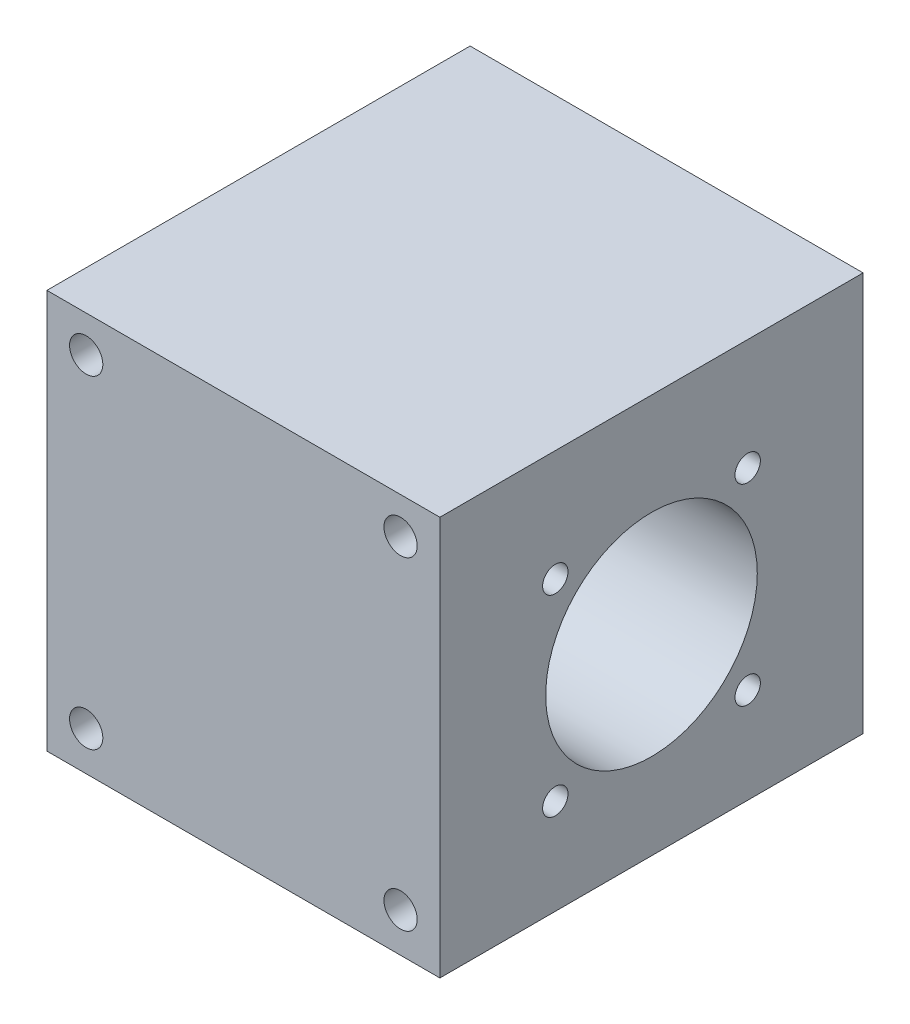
ISO-10303-21;
HEADER;
FILE_DESCRIPTION(('STEP AP214'),'2;1');
FILE_NAME('part.step','',(''),(''),'','','');
FILE_SCHEMA(('AUTOMOTIVE_DESIGN { 1 0 10303 214 1 1 1 1 }'));
ENDSEC;
DATA;
#1=APPLICATION_CONTEXT('core data for automotive mechanical design processes');
#2=APPLICATION_PROTOCOL_DEFINITION('international standard','automotive_design',2000,#1);
#3=PRODUCT_CONTEXT('',#1,'mechanical');
#4=PRODUCT('Part','Part','',(#3));
#5=PRODUCT_RELATED_PRODUCT_CATEGORY('part','',(#4));
#6=PRODUCT_DEFINITION_FORMATION('','',#4);
#7=PRODUCT_DEFINITION_CONTEXT('part definition',#1,'design');
#8=PRODUCT_DEFINITION('design','',#6,#7);
#9=PRODUCT_DEFINITION_SHAPE('','',#8);
#10=(LENGTH_UNIT() NAMED_UNIT(*) SI_UNIT(.MILLI.,.METRE.));
#11=(NAMED_UNIT(*) PLANE_ANGLE_UNIT() SI_UNIT($,.RADIAN.));
#12=(NAMED_UNIT(*) SI_UNIT($,.STERADIAN.) SOLID_ANGLE_UNIT());
#13=UNCERTAINTY_MEASURE_WITH_UNIT(LENGTH_MEASURE(1.E-05),#10,'distance_accuracy_value','');
#14=(GEOMETRIC_REPRESENTATION_CONTEXT(3) GLOBAL_UNCERTAINTY_ASSIGNED_CONTEXT((#13)) GLOBAL_UNIT_ASSIGNED_CONTEXT((#10,
#11,#12)) REPRESENTATION_CONTEXT('',''));
#15=CARTESIAN_POINT('',(0.,0.,0.));
#16=DIRECTION('',(0.,0.,1.));
#17=DIRECTION('',(1.,0.,0.));
#18=AXIS2_PLACEMENT_3D('',#15,#16,#17);
#19=CARTESIAN_POINT('',(0.,0.,70.));
#20=DIRECTION('',(1.,0.,0.));
#21=DIRECTION('',(0.,0.,-1.));
#22=AXIS2_PLACEMENT_3D('',#19,#20,#21);
#23=PLANE('',#22);
#24=CARTESIAN_POINT('',(0.,47.6099025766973,19.0900974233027));
#25=DIRECTION('',(-1.,0.,0.));
#26=DIRECTION('',(0.,0.,1.));
#27=AXIS2_PLACEMENT_3D('',#24,#25,#26);
#28=CIRCLE('',#27,2.1);
#29=CARTESIAN_POINT('',(0.,47.6099025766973,21.1900974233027));
#30=VERTEX_POINT('',#29);
#31=EDGE_CURVE('E762',#30,#30,#28,.T.);
#32=ORIENTED_EDGE('',*,*,#31,.F.);
#33=EDGE_LOOP('',(#32));
#34=FACE_BOUND('',#33,.T.);
#35=CARTESIAN_POINT('',(0.,47.6099025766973,50.9099025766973));
#36=DIRECTION('',(-1.,0.,0.));
#37=DIRECTION('',(0.,0.,1.));
#38=AXIS2_PLACEMENT_3D('',#35,#36,#37);
#39=CIRCLE('',#38,2.1);
#40=CARTESIAN_POINT('',(0.,47.6099025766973,53.0099025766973));
#41=VERTEX_POINT('',#40);
#42=EDGE_CURVE('E768',#41,#41,#39,.T.);
#43=ORIENTED_EDGE('',*,*,#42,.F.);
#44=EDGE_LOOP('',(#43));
#45=FACE_BOUND('',#44,.T.);
#46=CARTESIAN_POINT('',(0.,15.7900974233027,50.9099025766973));
#47=DIRECTION('',(-1.,0.,0.));
#48=DIRECTION('',(0.,0.,1.));
#49=AXIS2_PLACEMENT_3D('',#46,#47,#48);
#50=CIRCLE('',#49,2.1);
#51=CARTESIAN_POINT('',(0.,15.7900974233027,53.0099025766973));
#52=VERTEX_POINT('',#51);
#53=EDGE_CURVE('E774',#52,#52,#50,.T.);
#54=ORIENTED_EDGE('',*,*,#53,.F.);
#55=EDGE_LOOP('',(#54));
#56=FACE_BOUND('',#55,.T.);
#57=CARTESIAN_POINT('',(0.,15.7900974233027,19.0900974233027));
#58=DIRECTION('',(-1.,0.,0.));
#59=DIRECTION('',(0.,0.,1.));
#60=AXIS2_PLACEMENT_3D('',#57,#58,#59);
#61=CIRCLE('',#60,2.1);
#62=CARTESIAN_POINT('',(0.,15.7900974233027,21.1900974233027));
#63=VERTEX_POINT('',#62);
#64=EDGE_CURVE('E780',#63,#63,#61,.T.);
#65=ORIENTED_EDGE('',*,*,#64,.F.);
#66=EDGE_LOOP('',(#65));
#67=FACE_BOUND('',#66,.T.);
#68=CARTESIAN_POINT('',(0.,31.7,35.));
#69=DIRECTION('',(1.,0.,0.));
#70=DIRECTION('',(0.,0.,-1.));
#71=AXIS2_PLACEMENT_3D('',#68,#69,#70);
#72=CIRCLE('',#71,17.5);
#73=CARTESIAN_POINT('',(0.,31.7,17.5));
#74=VERTEX_POINT('',#73);
#75=EDGE_CURVE('E835',#74,#74,#72,.T.);
#76=ORIENTED_EDGE('',*,*,#75,.T.);
#77=EDGE_LOOP('',(#76));
#78=FACE_BOUND('',#77,.T.);
#79=DIRECTION('',(0.,-1.,0.));
#80=VECTOR('',#79,1.);
#81=CARTESIAN_POINT('',(0.,0.,0.));
#82=LINE('',#81,#80);
#83=CARTESIAN_POINT('',(0.,66.,0.));
#84=VERTEX_POINT('',#83);
#85=CARTESIAN_POINT('',(0.,0.,0.));
#86=VERTEX_POINT('',#85);
#87=EDGE_CURVE('E838',#84,#86,#82,.T.);
#88=ORIENTED_EDGE('',*,*,#87,.T.);
#89=DIRECTION('',(0.,0.,-1.));
#90=VECTOR('',#89,1.);
#91=CARTESIAN_POINT('',(0.,0.,70.));
#92=LINE('',#91,#90);
#93=CARTESIAN_POINT('',(0.,0.,70.));
#94=VERTEX_POINT('',#93);
#95=EDGE_CURVE('E11',#94,#86,#92,.T.);
#96=ORIENTED_EDGE('',*,*,#95,.F.);
#97=DIRECTION('',(0.,-1.,0.));
#98=VECTOR('',#97,1.);
#99=CARTESIAN_POINT('',(0.,0.,70.));
#100=LINE('',#99,#98);
#101=CARTESIAN_POINT('',(0.,66.,70.));
#102=VERTEX_POINT('',#101);
#103=EDGE_CURVE('E841',#102,#94,#100,.T.);
#104=ORIENTED_EDGE('',*,*,#103,.F.);
#105=DIRECTION('',(0.,0.,-1.));
#106=VECTOR('',#105,1.);
#107=CARTESIAN_POINT('',(0.,66.,70.));
#108=LINE('',#107,#106);
#109=EDGE_CURVE('E851',#102,#84,#108,.T.);
#110=ORIENTED_EDGE('',*,*,#109,.T.);
#111=EDGE_LOOP('',(#88,#96,#104,#110));
#112=FACE_BOUND('',#111,.T.);
#113=ADVANCED_FACE('F39',(#34,#45,#56,#67,#78,#112),#23,.F.);
#114=CARTESIAN_POINT('',(0.,0.,70.));
#115=DIRECTION('',(0.,1.,0.));
#116=DIRECTION('',(0.,0.,1.));
#117=AXIS2_PLACEMENT_3D('',#114,#115,#116);
#118=PLANE('',#117);
#119=DIRECTION('',(1.,0.,0.));
#120=VECTOR('',#119,1.);
#121=CARTESIAN_POINT('',(0.,0.,0.));
#122=LINE('',#121,#120);
#123=CARTESIAN_POINT('',(65.,0.,0.));
#124=VERTEX_POINT('',#123);
#125=EDGE_CURVE('E854',#86,#124,#122,.T.);
#126=ORIENTED_EDGE('',*,*,#125,.T.);
#127=DIRECTION('',(0.,0.,-1.));
#128=VECTOR('',#127,1.);
#129=CARTESIAN_POINT('',(65.,0.,70.));
#130=LINE('',#129,#128);
#131=CARTESIAN_POINT('',(65.,0.,70.));
#132=VERTEX_POINT('',#131);
#133=EDGE_CURVE('E46',#132,#124,#130,.T.);
#134=ORIENTED_EDGE('',*,*,#133,.F.);
#135=DIRECTION('',(1.,0.,0.));
#136=VECTOR('',#135,1.);
#137=CARTESIAN_POINT('',(0.,0.,70.));
#138=LINE('',#137,#136);
#139=EDGE_CURVE('E844',#94,#132,#138,.T.);
#140=ORIENTED_EDGE('',*,*,#139,.F.);
#141=ORIENTED_EDGE('',*,*,#95,.T.);
#142=EDGE_LOOP('',(#126,#134,#140,#141));
#143=FACE_BOUND('',#142,.T.);
#144=ADVANCED_FACE('F884',(#143),#118,.F.);
#145=CARTESIAN_POINT('',(65.,0.,70.));
#146=DIRECTION('',(-1.,0.,0.));
#147=DIRECTION('',(0.,0.,1.));
#148=AXIS2_PLACEMENT_3D('',#145,#146,#147);
#149=PLANE('',#148);
#150=CARTESIAN_POINT('',(65.,47.6099025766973,19.0900974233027));
#151=DIRECTION('',(1.,0.,0.));
#152=DIRECTION('',(0.,0.,-1.));
#153=AXIS2_PLACEMENT_3D('',#150,#151,#152);
#154=CIRCLE('',#153,2.1);
#155=CARTESIAN_POINT('',(65.,47.6099025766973,16.9900974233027));
#156=VERTEX_POINT('',#155);
#157=EDGE_CURVE('E712',#156,#156,#154,.T.);
#158=ORIENTED_EDGE('',*,*,#157,.F.);
#159=EDGE_LOOP('',(#158));
#160=FACE_BOUND('',#159,.T.);
#161=CARTESIAN_POINT('',(65.,47.6099025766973,50.9099025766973));
#162=DIRECTION('',(1.,0.,0.));
#163=DIRECTION('',(0.,0.,-1.));
#164=AXIS2_PLACEMENT_3D('',#161,#162,#163);
#165=CIRCLE('',#164,2.1);
#166=CARTESIAN_POINT('',(65.,47.6099025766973,48.8099025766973));
#167=VERTEX_POINT('',#166);
#168=EDGE_CURVE('E744',#167,#167,#165,.T.);
#169=ORIENTED_EDGE('',*,*,#168,.F.);
#170=EDGE_LOOP('',(#169));
#171=FACE_BOUND('',#170,.T.);
#172=CARTESIAN_POINT('',(65.,15.7900974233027,50.9099025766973));
#173=DIRECTION('',(1.,0.,0.));
#174=DIRECTION('',(0.,0.,-1.));
#175=AXIS2_PLACEMENT_3D('',#172,#173,#174);
#176=CIRCLE('',#175,2.1);
#177=CARTESIAN_POINT('',(65.,15.7900974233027,48.8099025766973));
#178=VERTEX_POINT('',#177);
#179=EDGE_CURVE('E750',#178,#178,#176,.T.);
#180=ORIENTED_EDGE('',*,*,#179,.F.);
#181=EDGE_LOOP('',(#180));
#182=FACE_BOUND('',#181,.T.);
#183=CARTESIAN_POINT('',(65.,15.7900974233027,19.0900974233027));
#184=DIRECTION('',(1.,0.,0.));
#185=DIRECTION('',(0.,0.,-1.));
#186=AXIS2_PLACEMENT_3D('',#183,#184,#185);
#187=CIRCLE('',#186,2.1);
#188=CARTESIAN_POINT('',(65.,15.7900974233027,16.9900974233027));
#189=VERTEX_POINT('',#188);
#190=EDGE_CURVE('E756',#189,#189,#187,.T.);
#191=ORIENTED_EDGE('',*,*,#190,.F.);
#192=EDGE_LOOP('',(#191));
#193=FACE_BOUND('',#192,.T.);
#194=CARTESIAN_POINT('',(65.,31.7,35.));
#195=DIRECTION('',(1.,0.,0.));
#196=DIRECTION('',(0.,0.,-1.));
#197=AXIS2_PLACEMENT_3D('',#194,#195,#196);
#198=CIRCLE('',#197,17.5);
#199=CARTESIAN_POINT('',(65.,31.7,17.5));
#200=VERTEX_POINT('',#199);
#201=EDGE_CURVE('E834',#200,#200,#198,.T.);
#202=ORIENTED_EDGE('',*,*,#201,.F.);
#203=EDGE_LOOP('',(#202));
#204=FACE_BOUND('',#203,.T.);
#205=DIRECTION('',(0.,1.,0.));
#206=VECTOR('',#205,1.);
#207=CARTESIAN_POINT('',(65.,0.,0.));
#208=LINE('',#207,#206);
#209=CARTESIAN_POINT('',(65.,66.,0.));
#210=VERTEX_POINT('',#209);
#211=EDGE_CURVE('E856',#124,#210,#208,.T.);
#212=ORIENTED_EDGE('',*,*,#211,.T.);
#213=DIRECTION('',(0.,0.,-1.));
#214=VECTOR('',#213,1.);
#215=CARTESIAN_POINT('',(65.,66.,70.));
#216=LINE('',#215,#214);
#217=CARTESIAN_POINT('',(65.,66.,70.));
#218=VERTEX_POINT('',#217);
#219=EDGE_CURVE('E861',#218,#210,#216,.T.);
#220=ORIENTED_EDGE('',*,*,#219,.F.);
#221=DIRECTION('',(0.,1.,0.));
#222=VECTOR('',#221,1.);
#223=CARTESIAN_POINT('',(65.,0.,70.));
#224=LINE('',#223,#222);
#225=EDGE_CURVE('E847',#132,#218,#224,.T.);
#226=ORIENTED_EDGE('',*,*,#225,.F.);
#227=ORIENTED_EDGE('',*,*,#133,.T.);
#228=EDGE_LOOP('',(#212,#220,#226,#227));
#229=FACE_BOUND('',#228,.T.);
#230=ADVANCED_FACE('F868',(#160,#171,#182,#193,#204,#229),#149,.F.);
#231=CARTESIAN_POINT('',(0.,66.,70.));
#232=DIRECTION('',(0.,-1.,0.));
#233=DIRECTION('',(0.,0.,-1.));
#234=AXIS2_PLACEMENT_3D('',#231,#232,#233);
#235=PLANE('',#234);
#236=DIRECTION('',(-1.,0.,0.));
#237=VECTOR('',#236,1.);
#238=CARTESIAN_POINT('',(0.,66.,0.));
#239=LINE('',#238,#237);
#240=EDGE_CURVE('E845',#210,#84,#239,.T.);
#241=ORIENTED_EDGE('',*,*,#240,.T.);
#242=ORIENTED_EDGE('',*,*,#109,.F.);
#243=DIRECTION('',(-1.,0.,0.));
#244=VECTOR('',#243,1.);
#245=CARTESIAN_POINT('',(0.,66.,70.));
#246=LINE('',#245,#244);
#247=EDGE_CURVE('E849',#218,#102,#246,.T.);
#248=ORIENTED_EDGE('',*,*,#247,.F.);
#249=ORIENTED_EDGE('',*,*,#219,.T.);
#250=EDGE_LOOP('',(#241,#242,#248,#249));
#251=FACE_BOUND('',#250,.T.);
#252=ADVANCED_FACE('F877',(#251),#235,.F.);
#253=CARTESIAN_POINT('',(0.,0.,70.));
#254=DIRECTION('',(0.,0.,-1.));
#255=DIRECTION('',(-1.,0.,0.));
#256=AXIS2_PLACEMENT_3D('',#253,#254,#255);
#257=PLANE('',#256);
#258=CARTESIAN_POINT('',(58.5,6.49999999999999,70.));
#259=DIRECTION('',(0.,0.,-1.));
#260=DIRECTION('',(-1.,0.,0.));
#261=AXIS2_PLACEMENT_3D('',#258,#259,#260);
#262=CIRCLE('',#261,2.74999999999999);
#263=CARTESIAN_POINT('',(55.75,6.49999999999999,70.));
#264=VERTEX_POINT('',#263);
#265=EDGE_CURVE('E795',#264,#264,#262,.T.);
#266=ORIENTED_EDGE('',*,*,#265,.T.);
#267=EDGE_LOOP('',(#266));
#268=FACE_BOUND('',#267,.T.);
#269=CARTESIAN_POINT('',(6.50000000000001,6.49999999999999,70.));
#270=DIRECTION('',(0.,0.,-1.));
#271=DIRECTION('',(-1.,0.,0.));
#272=AXIS2_PLACEMENT_3D('',#269,#270,#271);
#273=CIRCLE('',#272,2.74999999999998);
#274=CARTESIAN_POINT('',(3.75000000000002,6.49999999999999,70.));
#275=VERTEX_POINT('',#274);
#276=EDGE_CURVE('E807',#275,#275,#273,.T.);
#277=ORIENTED_EDGE('',*,*,#276,.T.);
#278=EDGE_LOOP('',(#277));
#279=FACE_BOUND('',#278,.T.);
#280=CARTESIAN_POINT('',(58.5,60.,70.));
#281=DIRECTION('',(0.,0.,-1.));
#282=DIRECTION('',(-1.,0.,0.));
#283=AXIS2_PLACEMENT_3D('',#280,#281,#282);
#284=CIRCLE('',#283,2.74999999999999);
#285=CARTESIAN_POINT('',(55.75,60.,70.));
#286=VERTEX_POINT('',#285);
#287=EDGE_CURVE('E819',#286,#286,#284,.T.);
#288=ORIENTED_EDGE('',*,*,#287,.T.);
#289=EDGE_LOOP('',(#288));
#290=FACE_BOUND('',#289,.T.);
#291=CARTESIAN_POINT('',(6.50000000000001,60.,70.));
#292=DIRECTION('',(0.,0.,-1.));
#293=DIRECTION('',(-1.,0.,0.));
#294=AXIS2_PLACEMENT_3D('',#291,#292,#293);
#295=CIRCLE('',#294,2.74999999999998);
#296=CARTESIAN_POINT('',(3.75000000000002,60.,70.));
#297=VERTEX_POINT('',#296);
#298=EDGE_CURVE('E831',#297,#297,#295,.T.);
#299=ORIENTED_EDGE('',*,*,#298,.T.);
#300=EDGE_LOOP('',(#299));
#301=FACE_BOUND('',#300,.T.);
#302=ORIENTED_EDGE('',*,*,#103,.T.);
#303=ORIENTED_EDGE('',*,*,#139,.T.);
#304=ORIENTED_EDGE('',*,*,#225,.T.);
#305=ORIENTED_EDGE('',*,*,#247,.T.);
#306=EDGE_LOOP('',(#302,#303,#304,#305));
#307=FACE_BOUND('',#306,.T.);
#308=ADVANCED_FACE('F883',(#268,#279,#290,#301,#307),#257,.F.);
#309=CARTESIAN_POINT('',(0.,0.,0.));
#310=DIRECTION('',(0.,0.,-1.));
#311=DIRECTION('',(-1.,0.,0.));
#312=AXIS2_PLACEMENT_3D('',#309,#310,#311);
#313=PLANE('',#312);
#314=DIRECTION('',(0.625725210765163,0.780043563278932,0.));
#315=VECTOR('',#314,1.);
#316=CARTESIAN_POINT('',(33.8246579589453,45.4665486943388,0.));
#317=LINE('',#316,#315);
#318=CARTESIAN_POINT('',(31.0830040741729,42.0487393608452,0.));
#319=VERTEX_POINT('',#318);
#320=CARTESIAN_POINT('',(33.8246579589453,45.4665486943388,0.));
#321=VERTEX_POINT('',#320);
#322=EDGE_CURVE('E53',#319,#321,#317,.T.);
#323=ORIENTED_EDGE('',*,*,#322,.F.);
#324=DIRECTION('',(0.625732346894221,0.780037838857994,0.));
#325=VECTOR('',#324,1.);
#326=CARTESIAN_POINT('',(31.0830040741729,42.0487393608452,0.));
#327=LINE('',#326,#325);
#328=CARTESIAN_POINT('',(28.9157236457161,39.3470079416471,0.));
#329=VERTEX_POINT('',#328);
#330=EDGE_CURVE('E1813',#329,#319,#327,.T.);
#331=ORIENTED_EDGE('',*,*,#330,.F.);
#332=DIRECTION('',(-0.278239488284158,0.960511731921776,0.));
#333=VECTOR('',#332,1.);
#334=CARTESIAN_POINT('',(28.9157236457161,39.3470079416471,0.));
#335=LINE('',#334,#333);
#336=CARTESIAN_POINT('',(29.866836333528,36.0636677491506,0.));
#337=VERTEX_POINT('',#336);
#338=EDGE_CURVE('E1846',#337,#329,#335,.T.);
#339=ORIENTED_EDGE('',*,*,#338,.F.);
#340=DIRECTION('',(-1.,0.,0.));
#341=VECTOR('',#340,1.);
#342=CARTESIAN_POINT('',(29.866836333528,36.0636677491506,0.));
#343=LINE('',#342,#341);
#344=CARTESIAN_POINT('',(35.133163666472,36.0636677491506,0.));
#345=VERTEX_POINT('',#344);
#346=EDGE_CURVE('E1843',#345,#337,#343,.T.);
#347=ORIENTED_EDGE('',*,*,#346,.F.);
#348=DIRECTION('',(0.273552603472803,-0.961857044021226,0.));
#349=VECTOR('',#348,1.);
#350=CARTESIAN_POINT('',(35.133163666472,36.0636677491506,0.));
#351=LINE('',#350,#349);
#352=CARTESIAN_POINT('',(34.0307418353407,39.939968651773,0.));
#353=VERTEX_POINT('',#352);
#354=EDGE_CURVE('E1840',#353,#345,#351,.T.);
#355=ORIENTED_EDGE('',*,*,#354,.F.);
#356=DIRECTION('',(-0.605226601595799,-0.796053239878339,0.));
#357=VECTOR('',#356,1.);
#358=CARTESIAN_POINT('',(34.0307418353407,39.939968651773,0.));
#359=LINE('',#358,#357);
#360=CARTESIAN_POINT('',(38.2325126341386,45.4665486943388,0.));
#361=VERTEX_POINT('',#360);
#362=EDGE_CURVE('E1837',#361,#353,#359,.T.);
#363=ORIENTED_EDGE('',*,*,#362,.F.);
#364=DIRECTION('',(1.,0.,0.));
#365=VECTOR('',#364,1.);
#366=CARTESIAN_POINT('',(38.2325126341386,45.4665486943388,0.));
#367=LINE('',#366,#365);
#368=EDGE_CURVE('E1833',#321,#361,#367,.T.);
#369=ORIENTED_EDGE('',*,*,#368,.F.);
#370=EDGE_LOOP('',(#323,#331,#339,#347,#355,#363,#369));
#371=FACE_BOUND('',#370,.T.);
#372=DIRECTION('',(-0.436182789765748,-0.899858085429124,0.));
#373=VECTOR('',#372,1.);
#374=CARTESIAN_POINT('',(14.8619511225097,36.0454592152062,0.));
#375=LINE('',#374,#373);
#376=CARTESIAN_POINT('',(16.1649715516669,38.7336291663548,0.));
#377=VERTEX_POINT('',#376);
#378=CARTESIAN_POINT('',(14.8619511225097,36.0454592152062,0.));
#379=VERTEX_POINT('',#378);
#380=EDGE_CURVE('E61',#377,#379,#375,.T.);
#381=ORIENTED_EDGE('',*,*,#380,.F.);
#382=DIRECTION('',(0.823965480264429,-0.566639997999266,0.));
#383=VECTOR('',#382,1.);
#384=CARTESIAN_POINT('',(16.1649715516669,38.7336291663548,0.));
#385=LINE('',#384,#383);
#386=CARTESIAN_POINT('',(12.6898696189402,41.1234522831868,0.));
#387=VERTEX_POINT('',#386);
#388=EDGE_CURVE('E1869',#387,#377,#385,.T.);
#389=ORIENTED_EDGE('',*,*,#388,.F.);
#390=DIRECTION('',(0.522587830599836,0.852585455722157,0.));
#391=VECTOR('',#390,1.);
#392=CARTESIAN_POINT('',(12.6898696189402,41.1234522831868,0.));
#393=LINE('',#392,#391);
#394=CARTESIAN_POINT('',(9.57734012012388,36.0454592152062,0.));
#395=VERTEX_POINT('',#394);
#396=EDGE_CURVE('E1883',#395,#387,#393,.T.);
#397=ORIENTED_EDGE('',*,*,#396,.F.);
#398=DIRECTION('',(-1.,0.,0.));
#399=VECTOR('',#398,1.);
#400=CARTESIAN_POINT('',(9.57734012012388,36.0454592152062,0.));
#401=LINE('',#400,#399);
#402=EDGE_CURVE('E1880',#379,#395,#401,.T.);
#403=ORIENTED_EDGE('',*,*,#402,.F.);
#404=EDGE_LOOP('',(#381,#389,#397,#403));
#405=FACE_BOUND('',#404,.T.);
#406=CARTESIAN_POINT('',(20.0971174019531,36.9065207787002,0.));
#407=CARTESIAN_POINT('',(15.8434640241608,39.4133665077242,0.));
#408=CARTESIAN_POINT('',(11.609771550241,42.8325474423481,0.));
#409=CARTESIAN_POINT('',(7.2467903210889,45.4665487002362,0.));
#410=B_SPLINE_CURVE_WITH_KNOTS('',3,(#406,#407,#408,#409),.UNSPECIFIED.,.F.,.F.,(4,4),(0.875,
1.),.UNSPECIFIED.);
#411=CARTESIAN_POINT('',(20.097117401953,36.9065207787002,0.));
#412=VERTEX_POINT('',#411);
#413=CARTESIAN_POINT('',(7.2467903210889,45.4665487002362,0.));
#414=VERTEX_POINT('',#413);
#415=EDGE_CURVE('E410',#412,#414,#410,.T.);
#416=ORIENTED_EDGE('',*,*,#415,.F.);
#417=DIRECTION('',(-0.278635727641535,0.96039686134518,0.));
#418=VECTOR('',#417,1.);
#419=CARTESIAN_POINT('',(20.097117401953,36.9065207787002,0.));
#420=LINE('',#419,#418);
#421=CARTESIAN_POINT('',(20.3469334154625,36.0454592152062,0.));
#422=VERTEX_POINT('',#421);
#423=EDGE_CURVE('E428',#422,#412,#420,.T.);
#424=ORIENTED_EDGE('',*,*,#423,.F.);
#425=DIRECTION('',(-1.,0.,0.));
#426=VECTOR('',#425,1.);
#427=CARTESIAN_POINT('',(20.3469334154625,36.0454592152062,0.));
#428=LINE('',#427,#426);
#429=CARTESIAN_POINT('',(25.3217701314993,36.0454592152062,0.));
#430=VERTEX_POINT('',#429);
#431=EDGE_CURVE('E431',#430,#422,#428,.T.);
#432=ORIENTED_EDGE('',*,*,#431,.F.);
#433=DIRECTION('',(0.278468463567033,-0.96044537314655,0.));
#434=VECTOR('',#433,1.);
#435=CARTESIAN_POINT('',(25.3217701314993,36.0454592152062,0.));
#436=LINE('',#435,#434);
#437=CARTESIAN_POINT('',(22.5902495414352,45.4665486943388,0.));
#438=VERTEX_POINT('',#437);
#439=EDGE_CURVE('E1757',#438,#430,#436,.T.);
#440=ORIENTED_EDGE('',*,*,#439,.F.);
#441=DIRECTION('',(1.,0.,0.));
#442=VECTOR('',#441,1.);
#443=CARTESIAN_POINT('',(22.5902495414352,45.4665486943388,0.));
#444=LINE('',#443,#442);
#445=CARTESIAN_POINT('',(17.5972049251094,45.4665486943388,0.));
#446=VERTEX_POINT('',#445);
#447=EDGE_CURVE('E1755',#446,#438,#444,.T.);
#448=ORIENTED_EDGE('',*,*,#447,.F.);
#449=DIRECTION('',(-0.281537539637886,0.959550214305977,0.));
#450=VECTOR('',#449,1.);
#451=CARTESIAN_POINT('',(17.5972049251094,45.4665486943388,0.));
#452=LINE('',#451,#450);
#453=CARTESIAN_POINT('',(18.8643412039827,41.1478319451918,0.));
#454=VERTEX_POINT('',#453);
#455=EDGE_CURVE('E1747',#454,#446,#452,.T.);
#456=ORIENTED_EDGE('',*,*,#455,.F.);
#457=DIRECTION('',(0.839276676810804,-0.543704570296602,0.));
#458=VECTOR('',#457,1.);
#459=CARTESIAN_POINT('',(18.8643412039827,41.1478319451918,0.));
#460=LINE('',#459,#458);
#461=CARTESIAN_POINT('',(12.1978564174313,45.4665487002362,0.));
#462=VERTEX_POINT('',#461);
#463=EDGE_CURVE('E1742',#462,#454,#460,.T.);
#464=ORIENTED_EDGE('',*,*,#463,.F.);
#465=DIRECTION('',(1.,0.,0.));
#466=VECTOR('',#465,1.);
#467=CARTESIAN_POINT('',(12.1978564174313,45.4665487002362,0.));
#468=LINE('',#467,#466);
#469=EDGE_CURVE('E1748',#414,#462,#468,.T.);
#470=ORIENTED_EDGE('',*,*,#469,.F.);
#471=EDGE_LOOP('',(#416,#424,#432,#440,#448,#456,#464,#470));
#472=FACE_BOUND('',#471,.T.);
#473=DIRECTION('',(0.690274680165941,-0.723547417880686,0.));
#474=VECTOR('',#473,1.);
#475=CARTESIAN_POINT('',(30.8045427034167,42.3406100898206,0.));
#476=LINE('',#475,#474);
#477=CARTESIAN_POINT('',(26.6903113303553,46.6531563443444,0.));
#478=VERTEX_POINT('',#477);
#479=CARTESIAN_POINT('',(30.8045427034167,42.3406100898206,0.));
#480=VERTEX_POINT('',#479);
#481=EDGE_CURVE('E1767',#478,#480,#476,.T.);
#482=ORIENTED_EDGE('',*,*,#481,.F.);
#483=DIRECTION('',(1.,0.,0.));
#484=VECTOR('',#483,1.);
#485=CARTESIAN_POINT('',(26.6903113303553,46.6531563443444,0.));
#486=LINE('',#485,#484);
#487=CARTESIAN_POINT('',(22.5586738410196,46.6531563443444,0.));
#488=VERTEX_POINT('',#487);
#489=EDGE_CURVE('E1782',#488,#478,#486,.T.);
#490=ORIENTED_EDGE('',*,*,#489,.F.);
#491=DIRECTION('',(-0.67301733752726,0.739626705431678,0.));
#492=VECTOR('',#491,1.);
#493=CARTESIAN_POINT('',(22.5586738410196,46.6531563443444,0.));
#494=LINE('',#493,#492);
#495=CARTESIAN_POINT('',(28.7797305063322,39.8163939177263,0.));
#496=VERTEX_POINT('',#495);
#497=EDGE_CURVE('E1796',#496,#488,#494,.T.);
#498=ORIENTED_EDGE('',*,*,#497,.F.);
#499=DIRECTION('',(-0.625719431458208,-0.780048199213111,0.));
#500=VECTOR('',#499,1.);
#501=CARTESIAN_POINT('',(28.7797305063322,39.8163939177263,0.));
#502=LINE('',#501,#500);
#503=EDGE_CURVE('E1793',#480,#496,#502,.T.);
#504=ORIENTED_EDGE('',*,*,#503,.F.);
#505=EDGE_LOOP('',(#482,#490,#498,#504));
#506=FACE_BOUND('',#505,.T.);
#507=DIRECTION('',(1.,0.,0.));
#508=VECTOR('',#507,1.);
#509=CARTESIAN_POINT('',(17.5442547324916,48.809390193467,0.));
#510=LINE('',#509,#508);
#511=CARTESIAN_POINT('',(17.5442547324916,48.809390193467,0.));
#512=VERTEX_POINT('',#511);
#513=CARTESIAN_POINT('',(20.4992308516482,48.809390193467,0.));
#514=VERTEX_POINT('',#513);
#515=EDGE_CURVE('E1921',#512,#514,#510,.T.);
#516=ORIENTED_EDGE('',*,*,#515,.F.);
#517=DIRECTION('',(-0.690267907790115,0.723553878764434,0.));
#518=VECTOR('',#517,1.);
#519=CARTESIAN_POINT('',(19.601294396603,46.6531563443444,0.));
#520=LINE('',#519,#518);
#521=CARTESIAN_POINT('',(19.601294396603,46.6531563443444,0.));
#522=VERTEX_POINT('',#521);
#523=EDGE_CURVE('E1962',#522,#512,#520,.T.);
#524=ORIENTED_EDGE('',*,*,#523,.F.);
#525=DIRECTION('',(-1.,0.,0.));
#526=VECTOR('',#525,1.);
#527=CARTESIAN_POINT('',(22.4596681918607,46.6531563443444,0.));
#528=LINE('',#527,#526);
#529=CARTESIAN_POINT('',(22.4596681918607,46.6531563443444,0.));
#530=VERTEX_POINT('',#529);
#531=EDGE_CURVE('E1981',#530,#522,#528,.T.);
#532=ORIENTED_EDGE('',*,*,#531,.F.);
#533=DIRECTION('',(-0.30448927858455,-0.952515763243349,0.));
#534=VECTOR('',#533,1.);
#535=CARTESIAN_POINT('',(22.4844951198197,46.7308209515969,0.));
#536=LINE('',#535,#534);
#537=CARTESIAN_POINT('',(22.4844951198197,46.7308209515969,0.));
#538=VERTEX_POINT('',#537);
#539=EDGE_CURVE('E1978',#538,#530,#536,.T.);
#540=ORIENTED_EDGE('',*,*,#539,.F.);
#541=DIRECTION('',(0.690689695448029,-0.723151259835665,0.));
#542=VECTOR('',#541,1.);
#543=CARTESIAN_POINT('',(20.4992308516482,48.809390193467,0.));
#544=LINE('',#543,#542);
#545=EDGE_CURVE('E1975',#514,#538,#544,.T.);
#546=ORIENTED_EDGE('',*,*,#545,.F.);
#547=EDGE_LOOP('',(#516,#524,#532,#540,#546));
#548=FACE_BOUND('',#547,.T.);
#549=DIRECTION('',(-0.690242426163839,0.723578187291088,0.));
#550=VECTOR('',#549,1.);
#551=CARTESIAN_POINT('',(21.0564597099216,49.0133423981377,0.));
#552=LINE('',#551,#550);
#553=CARTESIAN_POINT('',(21.0564597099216,49.0133423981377,0.));
#554=VERTEX_POINT('',#553);
#555=CARTESIAN_POINT('',(20.027939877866,50.091535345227,0.));
#556=VERTEX_POINT('',#555);
#557=EDGE_CURVE('E1908',#554,#556,#552,.T.);
#558=ORIENTED_EDGE('',*,*,#557,.F.);
#559=DIRECTION('',(-1.,0.,0.));
#560=VECTOR('',#559,1.);
#561=CARTESIAN_POINT('',(22.5340232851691,49.0133423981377,0.));
#562=LINE('',#561,#560);
#563=CARTESIAN_POINT('',(22.5340232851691,49.0133423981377,0.));
#564=VERTEX_POINT('',#563);
#565=EDGE_CURVE('E1898',#564,#554,#562,.T.);
#566=ORIENTED_EDGE('',*,*,#565,.F.);
#567=DIRECTION('',(0.690242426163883,-0.723578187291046,0.));
#568=VECTOR('',#567,1.);
#569=CARTESIAN_POINT('',(21.5055034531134,50.091535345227,0.));
#570=LINE('',#569,#568);
#571=CARTESIAN_POINT('',(21.5055034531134,50.091535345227,0.));
#572=VERTEX_POINT('',#571);
#573=EDGE_CURVE('E1914',#572,#564,#570,.T.);
#574=ORIENTED_EDGE('',*,*,#573,.F.);
#575=DIRECTION('',(1.,0.,0.));
#576=VECTOR('',#575,1.);
#577=CARTESIAN_POINT('',(20.027939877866,50.091535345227,0.));
#578=LINE('',#577,#576);
#579=EDGE_CURVE('E1910',#556,#572,#578,.T.);
#580=ORIENTED_EDGE('',*,*,#579,.F.);
#581=EDGE_LOOP('',(#558,#566,#574,#580));
#582=FACE_BOUND('',#581,.T.);
#583=DIRECTION('',(-0.690240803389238,0.723579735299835,0.));
#584=VECTOR('',#583,1.);
#585=CARTESIAN_POINT('',(24.3844448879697,47.3247413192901,0.));
#586=LINE('',#585,#584);
#587=CARTESIAN_POINT('',(24.3844448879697,47.3247413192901,0.));
#588=VERTEX_POINT('',#587);
#589=CARTESIAN_POINT('',(23.1746012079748,48.5930209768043,0.));
#590=VERTEX_POINT('',#589);
#591=EDGE_CURVE('E1853',#588,#590,#586,.T.);
#592=ORIENTED_EDGE('',*,*,#591,.F.);
#593=DIRECTION('',(-1.,0.,0.));
#594=VECTOR('',#593,1.);
#595=CARTESIAN_POINT('',(26.1224920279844,47.3247413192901,0.));
#596=LINE('',#595,#594);
#597=CARTESIAN_POINT('',(26.1224920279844,47.3247413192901,0.));
#598=VERTEX_POINT('',#597);
#599=EDGE_CURVE('E1932',#598,#588,#596,.T.);
#600=ORIENTED_EDGE('',*,*,#599,.F.);
#601=DIRECTION('',(0.690263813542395,-0.723557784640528,0.));
#602=VECTOR('',#601,1.);
#603=CARTESIAN_POINT('',(24.9125713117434,48.5930209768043,0.));
#604=LINE('',#603,#602);
#605=CARTESIAN_POINT('',(24.9125713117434,48.5930209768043,0.));
#606=VERTEX_POINT('',#605);
#607=EDGE_CURVE('E1946',#606,#598,#604,.T.);
#608=ORIENTED_EDGE('',*,*,#607,.F.);
#609=DIRECTION('',(1.,0.,0.));
#610=VECTOR('',#609,1.);
#611=CARTESIAN_POINT('',(23.1746012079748,48.5930209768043,0.));
#612=LINE('',#611,#610);
#613=EDGE_CURVE('E1943',#590,#606,#612,.T.);
#614=ORIENTED_EDGE('',*,*,#613,.F.);
#615=EDGE_LOOP('',(#592,#600,#608,#614));
#616=FACE_BOUND('',#615,.T.);
#617=CARTESIAN_POINT('',(40.9745465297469,39.9997751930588,0.));
#618=CARTESIAN_POINT('',(38.4609201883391,40.4856936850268,0.));
#619=CARTESIAN_POINT('',(37.2225060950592,41.4029048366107,0.));
#620=CARTESIAN_POINT('',(37.2593042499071,42.7514086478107,0.));
#621=B_SPLINE_CURVE_WITH_KNOTS('',3,(#617,#618,#619,#620),.UNSPECIFIED.,.F.,.F.,(4,4),
(0.923076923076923,1.),.UNSPECIFIED.);
#622=CARTESIAN_POINT('',(40.9745465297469,39.9997751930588,0.));
#623=VERTEX_POINT('',#622);
#624=CARTESIAN_POINT('',(37.2593042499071,42.7514086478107,0.));
#625=VERTEX_POINT('',#624);
#626=EDGE_CURVE('E637',#623,#625,#621,.T.);
#627=ORIENTED_EDGE('',*,*,#626,.F.);
#628=DIRECTION('',(0.466422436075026,0.884562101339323,0.));
#629=VECTOR('',#628,1.);
#630=CARTESIAN_POINT('',(40.9745465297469,39.9997751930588,0.));
#631=LINE('',#630,#629);
#632=CARTESIAN_POINT('',(38.8990688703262,36.0636676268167,0.));
#633=VERTEX_POINT('',#632);
#634=EDGE_CURVE('E706',#633,#623,#631,.T.);
#635=ORIENTED_EDGE('',*,*,#634,.F.);
#636=DIRECTION('',(-1.,0.,0.));
#637=VECTOR('',#636,1.);
#638=CARTESIAN_POINT('',(38.8990688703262,36.0636676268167,0.));
#639=LINE('',#638,#637);
#640=CARTESIAN_POINT('',(44.2383068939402,36.0636676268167,0.));
#641=VERTEX_POINT('',#640);
#642=EDGE_CURVE('E703',#641,#633,#639,.T.);
#643=ORIENTED_EDGE('',*,*,#642,.F.);
#644=DIRECTION('',(-0.426227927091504,-0.904615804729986,0.));
#645=VECTOR('',#644,1.);
#646=CARTESIAN_POINT('',(44.2383068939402,36.0636676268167,0.));
#647=LINE('',#646,#645);
#648=CARTESIAN_POINT('',(45.6999827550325,39.1658929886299,0.));
#649=VERTEX_POINT('',#648);
#650=EDGE_CURVE('E700',#649,#641,#647,.T.);
#651=ORIENTED_EDGE('',*,*,#650,.F.);
#652=DIRECTION('',(-0.426211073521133,-0.904623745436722,0.));
#653=VECTOR('',#652,1.);
#654=CARTESIAN_POINT('',(45.6999827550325,39.1658929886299,0.));
#655=LINE('',#654,#653);
#656=CARTESIAN_POINT('',(46.8483850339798,41.6033518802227,0.));
#657=VERTEX_POINT('',#656);
#658=EDGE_CURVE('E694',#657,#649,#655,.T.);
#659=ORIENTED_EDGE('',*,*,#658,.F.);
#660=CARTESIAN_POINT('',(42.5591524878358,42.6420807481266,0.));
#661=CARTESIAN_POINT('',(42.5250208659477,41.3920100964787,0.));
#662=CARTESIAN_POINT('',(45.8405879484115,41.6033518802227,0.));
#663=CARTESIAN_POINT('',(46.8483850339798,41.6033518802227,0.));
#664=B_SPLINE_CURVE_WITH_KNOTS('',3,(#660,#661,#662,#663),.UNSPECIFIED.,.F.,.F.,(4,4),
(0.230769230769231,0.307692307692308),.UNSPECIFIED.);
#665=CARTESIAN_POINT('',(42.5591524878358,42.6420807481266,0.));
#666=VERTEX_POINT('',#665);
#667=EDGE_CURVE('E686',#666,#657,#664,.T.);
#668=ORIENTED_EDGE('',*,*,#667,.F.);
#669=CARTESIAN_POINT('',(45.0425327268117,43.4984949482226,0.));
#670=CARTESIAN_POINT('',(43.4024625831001,43.4984949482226,0.));
#671=CARTESIAN_POINT('',(42.5746945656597,43.2130235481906,0.));
#672=CARTESIAN_POINT('',(42.5591524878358,42.6420807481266,0.));
#673=B_SPLINE_CURVE_WITH_KNOTS('',3,(#669,#670,#671,#672),.UNSPECIFIED.,.F.,.F.,(4,4),
(0.307692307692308,0.384615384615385),.UNSPECIFIED.);
#674=CARTESIAN_POINT('',(45.0425327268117,43.4984949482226,0.));
#675=VERTEX_POINT('',#674);
#676=EDGE_CURVE('E681',#675,#666,#673,.T.);
#677=ORIENTED_EDGE('',*,*,#676,.F.);
#678=DIRECTION('',(-1.,0.,0.));
#679=VECTOR('',#678,1.);
#680=CARTESIAN_POINT('',(45.0425327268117,43.4984949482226,0.));
#681=LINE('',#680,#679);
#682=CARTESIAN_POINT('',(46.9194676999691,43.4984949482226,0.));
#683=VERTEX_POINT('',#682);
#684=EDGE_CURVE('E675',#683,#675,#681,.T.);
#685=ORIENTED_EDGE('',*,*,#684,.F.);
#686=CARTESIAN_POINT('',(49.1038153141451,36.0636677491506,0.));
#687=CARTESIAN_POINT('',(48.3749375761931,38.5417149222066,0.));
#688=CARTESIAN_POINT('',(47.660763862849,41.0245618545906,0.));
#689=CARTESIAN_POINT('',(46.9194676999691,43.4984949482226,0.));
#690=B_SPLINE_CURVE_WITH_KNOTS('',3,(#686,#687,#688,#689),.UNSPECIFIED.,.F.,.F.,(4,4),
(0.461538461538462,0.538461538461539),.UNSPECIFIED.);
#691=CARTESIAN_POINT('',(49.1038153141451,36.0636677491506,0.));
#692=VERTEX_POINT('',#691);
#693=EDGE_CURVE('E670',#692,#683,#690,.T.);
#694=ORIENTED_EDGE('',*,*,#693,.F.);
#695=DIRECTION('',(-1.,0.,0.));
#696=VECTOR('',#695,1.);
#697=CARTESIAN_POINT('',(49.1038153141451,36.0636677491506,0.));
#698=LINE('',#697,#696);
#699=CARTESIAN_POINT('',(54.2426061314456,36.0636677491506,0.));
#700=VERTEX_POINT('',#699);
#701=EDGE_CURVE('E667',#700,#692,#698,.T.);
#702=ORIENTED_EDGE('',*,*,#701,.F.);
#703=DIRECTION('',(0.280722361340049,-0.959789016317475,0.));
#704=VECTOR('',#703,1.);
#705=CARTESIAN_POINT('',(54.2426061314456,36.0636677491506,0.));
#706=LINE('',#705,#704);
#707=CARTESIAN_POINT('',(51.492419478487,45.4665486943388,0.));
#708=VERTEX_POINT('',#707);
#709=EDGE_CURVE('E664',#708,#700,#706,.T.);
#710=ORIENTED_EDGE('',*,*,#709,.F.);
#711=DIRECTION('',(1.,0.,0.));
#712=VECTOR('',#711,1.);
#713=CARTESIAN_POINT('',(51.492419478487,45.4665486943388,0.));
#714=LINE('',#713,#712);
#715=CARTESIAN_POINT('',(43.6202043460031,45.4665486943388,0.));
#716=VERTEX_POINT('',#715);
#717=EDGE_CURVE('E658',#716,#708,#714,.T.);
#718=ORIENTED_EDGE('',*,*,#717,.F.);
#719=CARTESIAN_POINT('',(38.8533576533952,44.7376709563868,0.));
#720=CARTESIAN_POINT('',(39.8930769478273,45.2235894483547,0.));
#721=CARTESIAN_POINT('',(41.4821020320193,45.4665486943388,0.));
#722=CARTESIAN_POINT('',(43.6202043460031,45.4665486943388,0.));
#723=B_SPLINE_CURVE_WITH_KNOTS('',3,(#719,#720,#721,#722),.UNSPECIFIED.,.F.,.F.,(4,4),
(0.769230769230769,0.846153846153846),.UNSPECIFIED.);
#724=CARTESIAN_POINT('',(38.8533576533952,44.7376709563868,0.));
#725=VERTEX_POINT('',#724);
#726=EDGE_CURVE('E650',#725,#716,#723,.T.);
#727=ORIENTED_EDGE('',*,*,#726,.F.);
#728=CARTESIAN_POINT('',(37.2593042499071,42.7514086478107,0.));
#729=CARTESIAN_POINT('',(37.282160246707,43.5896142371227,0.));
#730=CARTESIAN_POINT('',(37.8135621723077,44.2517524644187,0.));
#731=CARTESIAN_POINT('',(38.8533576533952,44.7376709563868,0.));
#732=B_SPLINE_CURVE_WITH_KNOTS('',3,(#728,#729,#730,#731),.UNSPECIFIED.,.F.,.F.,(4,4),
(0.846153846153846,0.923076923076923),.UNSPECIFIED.);
#733=EDGE_CURVE('E641',#625,#725,#732,.T.);
#734=ORIENTED_EDGE('',*,*,#733,.F.);
#735=EDGE_LOOP('',(#627,#635,#643,#651,#659,#668,#677,#685,#694,#702,#710,#718,#727,#734));
#736=FACE_BOUND('',#735,.T.);
#737=CARTESIAN_POINT('',(58.5,6.49999999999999,0.));
#738=DIRECTION('',(0.,0.,-1.));
#739=DIRECTION('',(-1.,0.,0.));
#740=AXIS2_PLACEMENT_3D('',#737,#738,#739);
#741=CIRCLE('',#740,4.74999999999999);
#742=CARTESIAN_POINT('',(53.75,6.49999999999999,0.));
#743=VERTEX_POINT('',#742);
#744=EDGE_CURVE('E786',#743,#743,#741,.T.);
#745=ORIENTED_EDGE('',*,*,#744,.F.);
#746=EDGE_LOOP('',(#745));
#747=FACE_BOUND('',#746,.T.);
#748=CARTESIAN_POINT('',(6.50000000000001,6.49999999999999,0.));
#749=DIRECTION('',(0.,0.,-1.));
#750=DIRECTION('',(-1.,0.,0.));
#751=AXIS2_PLACEMENT_3D('',#748,#749,#750);
#752=CIRCLE('',#751,4.74999999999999);
#753=CARTESIAN_POINT('',(1.75000000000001,6.49999999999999,0.));
#754=VERTEX_POINT('',#753);
#755=EDGE_CURVE('E798',#754,#754,#752,.T.);
#756=ORIENTED_EDGE('',*,*,#755,.F.);
#757=EDGE_LOOP('',(#756));
#758=FACE_BOUND('',#757,.T.);
#759=CARTESIAN_POINT('',(58.5,60.,0.));
#760=DIRECTION('',(0.,0.,-1.));
#761=DIRECTION('',(-1.,0.,0.));
#762=AXIS2_PLACEMENT_3D('',#759,#760,#761);
#763=CIRCLE('',#762,4.74999999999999);
#764=CARTESIAN_POINT('',(53.75,60.,0.));
#765=VERTEX_POINT('',#764);
#766=EDGE_CURVE('E810',#765,#765,#763,.T.);
#767=ORIENTED_EDGE('',*,*,#766,.F.);
#768=EDGE_LOOP('',(#767));
#769=FACE_BOUND('',#768,.T.);
#770=CARTESIAN_POINT('',(6.50000000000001,60.,0.));
#771=DIRECTION('',(0.,0.,-1.));
#772=DIRECTION('',(-1.,0.,0.));
#773=AXIS2_PLACEMENT_3D('',#770,#771,#772);
#774=CIRCLE('',#773,4.74999999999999);
#775=CARTESIAN_POINT('',(1.75000000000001,60.,0.));
#776=VERTEX_POINT('',#775);
#777=EDGE_CURVE('E822',#776,#776,#774,.T.);
#778=ORIENTED_EDGE('',*,*,#777,.F.);
#779=EDGE_LOOP('',(#778));
#780=FACE_BOUND('',#779,.T.);
#781=ORIENTED_EDGE('',*,*,#87,.F.);
#782=ORIENTED_EDGE('',*,*,#240,.F.);
#783=ORIENTED_EDGE('',*,*,#211,.F.);
#784=ORIENTED_EDGE('',*,*,#125,.F.);
#785=EDGE_LOOP('',(#781,#782,#783,#784));
#786=FACE_BOUND('',#785,.T.);
#787=ADVANCED_FACE('F874',(#371,#405,#472,#506,#548,#582,#616,#736,#747,#758,#769,#780,#786),
#313,.T.);
#788=CARTESIAN_POINT('',(0.,31.7,35.));
#789=DIRECTION('',(1.,0.,0.));
#790=DIRECTION('',(0.,0.,-1.));
#791=AXIS2_PLACEMENT_3D('',#788,#789,#790);
#792=CYLINDRICAL_SURFACE('',#791,17.5);
#793=ORIENTED_EDGE('',*,*,#75,.F.);
#794=EDGE_LOOP('',(#793));
#795=FACE_BOUND('',#794,.T.);
#796=ORIENTED_EDGE('',*,*,#201,.T.);
#797=EDGE_LOOP('',(#796));
#798=FACE_BOUND('',#797,.T.);
#799=ADVANCED_FACE('F898',(#795,#798),#792,.F.);
#800=CARTESIAN_POINT('',(6.50000000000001,60.,0.));
#801=DIRECTION('',(0.,0.,-1.));
#802=DIRECTION('',(-1.,0.,0.));
#803=AXIS2_PLACEMENT_3D('',#800,#801,#802);
#804=CYLINDRICAL_SURFACE('',#803,2.74999999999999);
#805=ORIENTED_EDGE('',*,*,#298,.F.);
#806=EDGE_LOOP('',(#805));
#807=FACE_BOUND('',#806,.T.);
#808=CARTESIAN_POINT('',(6.50000000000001,60.,40.));
#809=DIRECTION('',(0.,0.,-1.));
#810=DIRECTION('',(-1.,0.,0.));
#811=AXIS2_PLACEMENT_3D('',#808,#809,#810);
#812=CIRCLE('',#811,2.74999999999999);
#813=CARTESIAN_POINT('',(3.75000000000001,60.,40.));
#814=VERTEX_POINT('',#813);
#815=EDGE_CURVE('E828',#814,#814,#812,.T.);
#816=ORIENTED_EDGE('',*,*,#815,.T.);
#817=EDGE_LOOP('',(#816));
#818=FACE_BOUND('',#817,.T.);
#819=ADVANCED_FACE('F905',(#807,#818),#804,.F.);
#820=CARTESIAN_POINT('',(9.25,60.,40.));
#821=DIRECTION('',(0.,0.,1.));
#822=DIRECTION('',(1.,0.,0.));
#823=AXIS2_PLACEMENT_3D('',#820,#821,#822);
#824=PLANE('',#823);
#825=ORIENTED_EDGE('',*,*,#815,.F.);
#826=EDGE_LOOP('',(#825));
#827=FACE_BOUND('',#826,.T.);
#828=CARTESIAN_POINT('',(6.50000000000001,60.,40.));
#829=DIRECTION('',(0.,0.,-1.));
#830=DIRECTION('',(-1.,0.,0.));
#831=AXIS2_PLACEMENT_3D('',#828,#829,#830);
#832=CIRCLE('',#831,4.74999999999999);
#833=CARTESIAN_POINT('',(1.75000000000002,60.,40.));
#834=VERTEX_POINT('',#833);
#835=EDGE_CURVE('E825',#834,#834,#832,.T.);
#836=ORIENTED_EDGE('',*,*,#835,.T.);
#837=EDGE_LOOP('',(#836));
#838=FACE_BOUND('',#837,.T.);
#839=ADVANCED_FACE('F909',(#827,#838),#824,.F.);
#840=CARTESIAN_POINT('',(6.50000000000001,60.,0.));
#841=DIRECTION('',(0.,0.,-1.));
#842=DIRECTION('',(-1.,0.,0.));
#843=AXIS2_PLACEMENT_3D('',#840,#841,#842);
#844=CYLINDRICAL_SURFACE('',#843,4.74999999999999);
#845=ORIENTED_EDGE('',*,*,#835,.F.);
#846=EDGE_LOOP('',(#845));
#847=FACE_BOUND('',#846,.T.);
#848=ORIENTED_EDGE('',*,*,#777,.T.);
#849=EDGE_LOOP('',(#848));
#850=FACE_BOUND('',#849,.T.);
#851=ADVANCED_FACE('F913',(#847,#850),#844,.F.);
#852=CARTESIAN_POINT('',(58.5,60.,0.));
#853=DIRECTION('',(0.,0.,-1.));
#854=DIRECTION('',(-1.,0.,0.));
#855=AXIS2_PLACEMENT_3D('',#852,#853,#854);
#856=CYLINDRICAL_SURFACE('',#855,2.74999999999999);
#857=ORIENTED_EDGE('',*,*,#287,.F.);
#858=EDGE_LOOP('',(#857));
#859=FACE_BOUND('',#858,.T.);
#860=CARTESIAN_POINT('',(58.5,60.,40.));
#861=DIRECTION('',(0.,0.,-1.));
#862=DIRECTION('',(-1.,0.,0.));
#863=AXIS2_PLACEMENT_3D('',#860,#861,#862);
#864=CIRCLE('',#863,2.75);
#865=CARTESIAN_POINT('',(55.75,60.,40.));
#866=VERTEX_POINT('',#865);
#867=EDGE_CURVE('E816',#866,#866,#864,.T.);
#868=ORIENTED_EDGE('',*,*,#867,.T.);
#869=EDGE_LOOP('',(#868));
#870=FACE_BOUND('',#869,.T.);
#871=ADVANCED_FACE('F917',(#859,#870),#856,.F.);
#872=CARTESIAN_POINT('',(61.25,60.,40.));
#873=DIRECTION('',(0.,0.,1.));
#874=DIRECTION('',(1.,0.,0.));
#875=AXIS2_PLACEMENT_3D('',#872,#873,#874);
#876=PLANE('',#875);
#877=ORIENTED_EDGE('',*,*,#867,.F.);
#878=EDGE_LOOP('',(#877));
#879=FACE_BOUND('',#878,.T.);
#880=CARTESIAN_POINT('',(58.5,60.,40.));
#881=DIRECTION('',(0.,0.,-1.));
#882=DIRECTION('',(-1.,0.,0.));
#883=AXIS2_PLACEMENT_3D('',#880,#881,#882);
#884=CIRCLE('',#883,4.74999999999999);
#885=CARTESIAN_POINT('',(53.75,60.,40.));
#886=VERTEX_POINT('',#885);
#887=EDGE_CURVE('E813',#886,#886,#884,.T.);
#888=ORIENTED_EDGE('',*,*,#887,.T.);
#889=EDGE_LOOP('',(#888));
#890=FACE_BOUND('',#889,.T.);
#891=ADVANCED_FACE('F921',(#879,#890),#876,.F.);
#892=CARTESIAN_POINT('',(58.5,60.,0.));
#893=DIRECTION('',(0.,0.,-1.));
#894=DIRECTION('',(-1.,0.,0.));
#895=AXIS2_PLACEMENT_3D('',#892,#893,#894);
#896=CYLINDRICAL_SURFACE('',#895,4.74999999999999);
#897=ORIENTED_EDGE('',*,*,#887,.F.);
#898=EDGE_LOOP('',(#897));
#899=FACE_BOUND('',#898,.T.);
#900=ORIENTED_EDGE('',*,*,#766,.T.);
#901=EDGE_LOOP('',(#900));
#902=FACE_BOUND('',#901,.T.);
#903=ADVANCED_FACE('F925',(#899,#902),#896,.F.);
#904=CARTESIAN_POINT('',(6.50000000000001,6.49999999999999,0.));
#905=DIRECTION('',(0.,0.,-1.));
#906=DIRECTION('',(-1.,0.,0.));
#907=AXIS2_PLACEMENT_3D('',#904,#905,#906);
#908=CYLINDRICAL_SURFACE('',#907,2.74999999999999);
#909=ORIENTED_EDGE('',*,*,#276,.F.);
#910=EDGE_LOOP('',(#909));
#911=FACE_BOUND('',#910,.T.);
#912=CARTESIAN_POINT('',(6.50000000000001,6.49999999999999,40.));
#913=DIRECTION('',(0.,0.,-1.));
#914=DIRECTION('',(-1.,0.,0.));
#915=AXIS2_PLACEMENT_3D('',#912,#913,#914);
#916=CIRCLE('',#915,2.74999999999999);
#917=CARTESIAN_POINT('',(3.75000000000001,6.49999999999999,40.));
#918=VERTEX_POINT('',#917);
#919=EDGE_CURVE('E804',#918,#918,#916,.T.);
#920=ORIENTED_EDGE('',*,*,#919,.T.);
#921=EDGE_LOOP('',(#920));
#922=FACE_BOUND('',#921,.T.);
#923=ADVANCED_FACE('F929',(#911,#922),#908,.F.);
#924=CARTESIAN_POINT('',(9.25,6.49999999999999,40.));
#925=DIRECTION('',(0.,0.,1.));
#926=DIRECTION('',(1.,0.,0.));
#927=AXIS2_PLACEMENT_3D('',#924,#925,#926);
#928=PLANE('',#927);
#929=ORIENTED_EDGE('',*,*,#919,.F.);
#930=EDGE_LOOP('',(#929));
#931=FACE_BOUND('',#930,.T.);
#932=CARTESIAN_POINT('',(6.50000000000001,6.49999999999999,40.));
#933=DIRECTION('',(0.,0.,-1.));
#934=DIRECTION('',(-1.,0.,0.));
#935=AXIS2_PLACEMENT_3D('',#932,#933,#934);
#936=CIRCLE('',#935,4.74999999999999);
#937=CARTESIAN_POINT('',(1.75000000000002,6.49999999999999,40.));
#938=VERTEX_POINT('',#937);
#939=EDGE_CURVE('E801',#938,#938,#936,.T.);
#940=ORIENTED_EDGE('',*,*,#939,.T.);
#941=EDGE_LOOP('',(#940));
#942=FACE_BOUND('',#941,.T.);
#943=ADVANCED_FACE('F933',(#931,#942),#928,.F.);
#944=CARTESIAN_POINT('',(6.50000000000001,6.49999999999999,0.));
#945=DIRECTION('',(0.,0.,-1.));
#946=DIRECTION('',(-1.,0.,0.));
#947=AXIS2_PLACEMENT_3D('',#944,#945,#946);
#948=CYLINDRICAL_SURFACE('',#947,4.74999999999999);
#949=ORIENTED_EDGE('',*,*,#939,.F.);
#950=EDGE_LOOP('',(#949));
#951=FACE_BOUND('',#950,.T.);
#952=ORIENTED_EDGE('',*,*,#755,.T.);
#953=EDGE_LOOP('',(#952));
#954=FACE_BOUND('',#953,.T.);
#955=ADVANCED_FACE('F937',(#951,#954),#948,.F.);
#956=CARTESIAN_POINT('',(58.5,6.49999999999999,0.));
#957=DIRECTION('',(0.,0.,-1.));
#958=DIRECTION('',(-1.,0.,0.));
#959=AXIS2_PLACEMENT_3D('',#956,#957,#958);
#960=CYLINDRICAL_SURFACE('',#959,2.74999999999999);
#961=ORIENTED_EDGE('',*,*,#265,.F.);
#962=EDGE_LOOP('',(#961));
#963=FACE_BOUND('',#962,.T.);
#964=CARTESIAN_POINT('',(58.5,6.49999999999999,40.));
#965=DIRECTION('',(0.,0.,-1.));
#966=DIRECTION('',(-1.,0.,0.));
#967=AXIS2_PLACEMENT_3D('',#964,#965,#966);
#968=CIRCLE('',#967,2.75);
#969=CARTESIAN_POINT('',(55.75,6.49999999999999,40.));
#970=VERTEX_POINT('',#969);
#971=EDGE_CURVE('E792',#970,#970,#968,.T.);
#972=ORIENTED_EDGE('',*,*,#971,.T.);
#973=EDGE_LOOP('',(#972));
#974=FACE_BOUND('',#973,.T.);
#975=ADVANCED_FACE('F941',(#963,#974),#960,.F.);
#976=CARTESIAN_POINT('',(61.25,6.49999999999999,40.));
#977=DIRECTION('',(0.,0.,1.));
#978=DIRECTION('',(1.,0.,0.));
#979=AXIS2_PLACEMENT_3D('',#976,#977,#978);
#980=PLANE('',#979);
#981=ORIENTED_EDGE('',*,*,#971,.F.);
#982=EDGE_LOOP('',(#981));
#983=FACE_BOUND('',#982,.T.);
#984=CARTESIAN_POINT('',(58.5,6.49999999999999,40.));
#985=DIRECTION('',(0.,0.,-1.));
#986=DIRECTION('',(-1.,0.,0.));
#987=AXIS2_PLACEMENT_3D('',#984,#985,#986);
#988=CIRCLE('',#987,4.74999999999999);
#989=CARTESIAN_POINT('',(53.75,6.49999999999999,40.));
#990=VERTEX_POINT('',#989);
#991=EDGE_CURVE('E789',#990,#990,#988,.T.);
#992=ORIENTED_EDGE('',*,*,#991,.T.);
#993=EDGE_LOOP('',(#992));
#994=FACE_BOUND('',#993,.T.);
#995=ADVANCED_FACE('F945',(#983,#994),#980,.F.);
#996=CARTESIAN_POINT('',(58.5,6.49999999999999,0.));
#997=DIRECTION('',(0.,0.,-1.));
#998=DIRECTION('',(-1.,0.,0.));
#999=AXIS2_PLACEMENT_3D('',#996,#997,#998);
#1000=CYLINDRICAL_SURFACE('',#999,4.74999999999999);
#1001=ORIENTED_EDGE('',*,*,#991,.F.);
#1002=EDGE_LOOP('',(#1001));
#1003=FACE_BOUND('',#1002,.T.);
#1004=ORIENTED_EDGE('',*,*,#744,.T.);
#1005=EDGE_LOOP('',(#1004));
#1006=FACE_BOUND('',#1005,.T.);
#1007=ADVANCED_FACE('F949',(#1003,#1006),#1000,.F.);
#1008=CARTESIAN_POINT('',(12.4,15.7900974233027,19.0900974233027));
#1009=DIRECTION('',(-1.,0.,0.));
#1010=DIRECTION('',(0.,0.,1.));
#1011=AXIS2_PLACEMENT_3D('',#1008,#1009,#1010);
#1012=CONICAL_SURFACE('',#1011,2.1,1.02974425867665);
#1013=CARTESIAN_POINT('',(13.6618072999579,15.7900974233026,19.0900974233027));
#1014=VERTEX_POINT('',#1013);
#1015=VERTEX_LOOP('',#1014);
#1016=FACE_BOUND('',#1015,.T.);
#1017=CARTESIAN_POINT('',(12.4,15.7900974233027,19.0900974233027));
#1018=DIRECTION('',(-1.,0.,0.));
#1019=DIRECTION('',(0.,0.,1.));
#1020=AXIS2_PLACEMENT_3D('',#1017,#1018,#1019);
#1021=CIRCLE('',#1020,2.1);
#1022=CARTESIAN_POINT('',(12.4,15.7900974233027,21.1900974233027));
#1023=VERTEX_POINT('',#1022);
#1024=EDGE_CURVE('E783',#1023,#1023,#1021,.T.);
#1025=ORIENTED_EDGE('',*,*,#1024,.T.);
#1026=EDGE_LOOP('',(#1025));
#1027=FACE_BOUND('',#1026,.T.);
#1028=ADVANCED_FACE('F953',(#1016,#1027),#1012,.F.);
#1029=CARTESIAN_POINT('',(0.,15.7900974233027,19.0900974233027));
#1030=DIRECTION('',(-1.,0.,0.));
#1031=DIRECTION('',(0.,0.,1.));
#1032=AXIS2_PLACEMENT_3D('',#1029,#1030,#1031);
#1033=CYLINDRICAL_SURFACE('',#1032,2.1);
#1034=ORIENTED_EDGE('',*,*,#1024,.F.);
#1035=EDGE_LOOP('',(#1034));
#1036=FACE_BOUND('',#1035,.T.);
#1037=ORIENTED_EDGE('',*,*,#64,.T.);
#1038=EDGE_LOOP('',(#1037));
#1039=FACE_BOUND('',#1038,.T.);
#1040=ADVANCED_FACE('F957',(#1036,#1039),#1033,.F.);
#1041=CARTESIAN_POINT('',(12.4,15.7900974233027,50.9099025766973));
#1042=DIRECTION('',(-1.,0.,0.));
#1043=DIRECTION('',(0.,0.,1.));
#1044=AXIS2_PLACEMENT_3D('',#1041,#1042,#1043);
#1045=CONICAL_SURFACE('',#1044,2.1,1.02974425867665);
#1046=CARTESIAN_POINT('',(13.6618072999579,15.7900974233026,50.9099025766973));
#1047=VERTEX_POINT('',#1046);
#1048=VERTEX_LOOP('',#1047);
#1049=FACE_BOUND('',#1048,.T.);
#1050=CARTESIAN_POINT('',(12.4,15.7900974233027,50.9099025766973));
#1051=DIRECTION('',(-1.,0.,0.));
#1052=DIRECTION('',(0.,0.,1.));
#1053=AXIS2_PLACEMENT_3D('',#1050,#1051,#1052);
#1054=CIRCLE('',#1053,2.1);
#1055=CARTESIAN_POINT('',(12.4,15.7900974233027,53.0099025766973));
#1056=VERTEX_POINT('',#1055);
#1057=EDGE_CURVE('E777',#1056,#1056,#1054,.T.);
#1058=ORIENTED_EDGE('',*,*,#1057,.T.);
#1059=EDGE_LOOP('',(#1058));
#1060=FACE_BOUND('',#1059,.T.);
#1061=ADVANCED_FACE('F961',(#1049,#1060),#1045,.F.);
#1062=CARTESIAN_POINT('',(0.,15.7900974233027,50.9099025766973));
#1063=DIRECTION('',(-1.,0.,0.));
#1064=DIRECTION('',(0.,0.,1.));
#1065=AXIS2_PLACEMENT_3D('',#1062,#1063,#1064);
#1066=CYLINDRICAL_SURFACE('',#1065,2.1);
#1067=ORIENTED_EDGE('',*,*,#1057,.F.);
#1068=EDGE_LOOP('',(#1067));
#1069=FACE_BOUND('',#1068,.T.);
#1070=ORIENTED_EDGE('',*,*,#53,.T.);
#1071=EDGE_LOOP('',(#1070));
#1072=FACE_BOUND('',#1071,.T.);
#1073=ADVANCED_FACE('F965',(#1069,#1072),#1066,.F.);
#1074=CARTESIAN_POINT('',(12.4,47.6099025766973,50.9099025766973));
#1075=DIRECTION('',(-1.,0.,0.));
#1076=DIRECTION('',(0.,0.,1.));
#1077=AXIS2_PLACEMENT_3D('',#1074,#1075,#1076);
#1078=CONICAL_SURFACE('',#1077,2.1,1.02974425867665);
#1079=CARTESIAN_POINT('',(13.6618072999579,47.6099025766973,50.9099025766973));
#1080=VERTEX_POINT('',#1079);
#1081=VERTEX_LOOP('',#1080);
#1082=FACE_BOUND('',#1081,.T.);
#1083=CARTESIAN_POINT('',(12.4,47.6099025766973,50.9099025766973));
#1084=DIRECTION('',(-1.,0.,0.));
#1085=DIRECTION('',(0.,0.,1.));
#1086=AXIS2_PLACEMENT_3D('',#1083,#1084,#1085);
#1087=CIRCLE('',#1086,2.1);
#1088=CARTESIAN_POINT('',(12.4,47.6099025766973,53.0099025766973));
#1089=VERTEX_POINT('',#1088);
#1090=EDGE_CURVE('E771',#1089,#1089,#1087,.T.);
#1091=ORIENTED_EDGE('',*,*,#1090,.T.);
#1092=EDGE_LOOP('',(#1091));
#1093=FACE_BOUND('',#1092,.T.);
#1094=ADVANCED_FACE('F969',(#1082,#1093),#1078,.F.);
#1095=CARTESIAN_POINT('',(0.,47.6099025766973,50.9099025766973));
#1096=DIRECTION('',(-1.,0.,0.));
#1097=DIRECTION('',(0.,0.,1.));
#1098=AXIS2_PLACEMENT_3D('',#1095,#1096,#1097);
#1099=CYLINDRICAL_SURFACE('',#1098,2.1);
#1100=ORIENTED_EDGE('',*,*,#1090,.F.);
#1101=EDGE_LOOP('',(#1100));
#1102=FACE_BOUND('',#1101,.T.);
#1103=ORIENTED_EDGE('',*,*,#42,.T.);
#1104=EDGE_LOOP('',(#1103));
#1105=FACE_BOUND('',#1104,.T.);
#1106=ADVANCED_FACE('F973',(#1102,#1105),#1099,.F.);
#1107=CARTESIAN_POINT('',(12.4,47.6099025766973,19.0900974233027));
#1108=DIRECTION('',(-1.,0.,0.));
#1109=DIRECTION('',(0.,0.,1.));
#1110=AXIS2_PLACEMENT_3D('',#1107,#1108,#1109);
#1111=CONICAL_SURFACE('',#1110,2.1,1.02974425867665);
#1112=CARTESIAN_POINT('',(13.6618072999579,47.6099025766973,19.0900974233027));
#1113=VERTEX_POINT('',#1112);
#1114=VERTEX_LOOP('',#1113);
#1115=FACE_BOUND('',#1114,.T.);
#1116=CARTESIAN_POINT('',(12.4,47.6099025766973,19.0900974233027));
#1117=DIRECTION('',(-1.,0.,0.));
#1118=DIRECTION('',(0.,0.,1.));
#1119=AXIS2_PLACEMENT_3D('',#1116,#1117,#1118);
#1120=CIRCLE('',#1119,2.1);
#1121=CARTESIAN_POINT('',(12.4,47.6099025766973,21.1900974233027));
#1122=VERTEX_POINT('',#1121);
#1123=EDGE_CURVE('E765',#1122,#1122,#1120,.T.);
#1124=ORIENTED_EDGE('',*,*,#1123,.T.);
#1125=EDGE_LOOP('',(#1124));
#1126=FACE_BOUND('',#1125,.T.);
#1127=ADVANCED_FACE('F977',(#1115,#1126),#1111,.F.);
#1128=CARTESIAN_POINT('',(0.,47.6099025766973,19.0900974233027));
#1129=DIRECTION('',(-1.,0.,0.));
#1130=DIRECTION('',(0.,0.,1.));
#1131=AXIS2_PLACEMENT_3D('',#1128,#1129,#1130);
#1132=CYLINDRICAL_SURFACE('',#1131,2.1);
#1133=ORIENTED_EDGE('',*,*,#1123,.F.);
#1134=EDGE_LOOP('',(#1133));
#1135=FACE_BOUND('',#1134,.T.);
#1136=ORIENTED_EDGE('',*,*,#31,.T.);
#1137=EDGE_LOOP('',(#1136));
#1138=FACE_BOUND('',#1137,.T.);
#1139=ADVANCED_FACE('F981',(#1135,#1138),#1132,.F.);
#1140=CARTESIAN_POINT('',(52.6,15.7900974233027,19.0900974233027));
#1141=DIRECTION('',(1.,0.,0.));
#1142=DIRECTION('',(0.,0.,-1.));
#1143=AXIS2_PLACEMENT_3D('',#1140,#1141,#1142);
#1144=CONICAL_SURFACE('',#1143,2.1,1.02974425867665);
#1145=CARTESIAN_POINT('',(51.3381927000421,15.7900974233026,19.0900974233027));
#1146=VERTEX_POINT('',#1145);
#1147=VERTEX_LOOP('',#1146);
#1148=FACE_BOUND('',#1147,.T.);
#1149=CARTESIAN_POINT('',(52.6,15.7900974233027,19.0900974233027));
#1150=DIRECTION('',(1.,0.,0.));
#1151=DIRECTION('',(0.,0.,-1.));
#1152=AXIS2_PLACEMENT_3D('',#1149,#1150,#1151);
#1153=CIRCLE('',#1152,2.1);
#1154=CARTESIAN_POINT('',(52.6,15.7900974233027,16.9900974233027));
#1155=VERTEX_POINT('',#1154);
#1156=EDGE_CURVE('E759',#1155,#1155,#1153,.T.);
#1157=ORIENTED_EDGE('',*,*,#1156,.T.);
#1158=EDGE_LOOP('',(#1157));
#1159=FACE_BOUND('',#1158,.T.);
#1160=ADVANCED_FACE('F985',(#1148,#1159),#1144,.F.);
#1161=CARTESIAN_POINT('',(65.,15.7900974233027,19.0900974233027));
#1162=DIRECTION('',(1.,0.,0.));
#1163=DIRECTION('',(0.,0.,-1.));
#1164=AXIS2_PLACEMENT_3D('',#1161,#1162,#1163);
#1165=CYLINDRICAL_SURFACE('',#1164,2.1);
#1166=ORIENTED_EDGE('',*,*,#1156,.F.);
#1167=EDGE_LOOP('',(#1166));
#1168=FACE_BOUND('',#1167,.T.);
#1169=ORIENTED_EDGE('',*,*,#190,.T.);
#1170=EDGE_LOOP('',(#1169));
#1171=FACE_BOUND('',#1170,.T.);
#1172=ADVANCED_FACE('F989',(#1168,#1171),#1165,.F.);
#1173=CARTESIAN_POINT('',(52.6,15.7900974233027,50.9099025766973));
#1174=DIRECTION('',(1.,0.,0.));
#1175=DIRECTION('',(0.,0.,-1.));
#1176=AXIS2_PLACEMENT_3D('',#1173,#1174,#1175);
#1177=CONICAL_SURFACE('',#1176,2.1,1.02974425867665);
#1178=CARTESIAN_POINT('',(51.3381927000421,15.7900974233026,50.9099025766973));
#1179=VERTEX_POINT('',#1178);
#1180=VERTEX_LOOP('',#1179);
#1181=FACE_BOUND('',#1180,.T.);
#1182=CARTESIAN_POINT('',(52.6,15.7900974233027,50.9099025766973));
#1183=DIRECTION('',(1.,0.,0.));
#1184=DIRECTION('',(0.,0.,-1.));
#1185=AXIS2_PLACEMENT_3D('',#1182,#1183,#1184);
#1186=CIRCLE('',#1185,2.1);
#1187=CARTESIAN_POINT('',(52.6,15.7900974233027,48.8099025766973));
#1188=VERTEX_POINT('',#1187);
#1189=EDGE_CURVE('E753',#1188,#1188,#1186,.T.);
#1190=ORIENTED_EDGE('',*,*,#1189,.T.);
#1191=EDGE_LOOP('',(#1190));
#1192=FACE_BOUND('',#1191,.T.);
#1193=ADVANCED_FACE('F993',(#1181,#1192),#1177,.F.);
#1194=CARTESIAN_POINT('',(65.,15.7900974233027,50.9099025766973));
#1195=DIRECTION('',(1.,0.,0.));
#1196=DIRECTION('',(0.,0.,-1.));
#1197=AXIS2_PLACEMENT_3D('',#1194,#1195,#1196);
#1198=CYLINDRICAL_SURFACE('',#1197,2.1);
#1199=ORIENTED_EDGE('',*,*,#1189,.F.);
#1200=EDGE_LOOP('',(#1199));
#1201=FACE_BOUND('',#1200,.T.);
#1202=ORIENTED_EDGE('',*,*,#179,.T.);
#1203=EDGE_LOOP('',(#1202));
#1204=FACE_BOUND('',#1203,.T.);
#1205=ADVANCED_FACE('F997',(#1201,#1204),#1198,.F.);
#1206=CARTESIAN_POINT('',(52.6,47.6099025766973,50.9099025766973));
#1207=DIRECTION('',(1.,0.,0.));
#1208=DIRECTION('',(0.,0.,-1.));
#1209=AXIS2_PLACEMENT_3D('',#1206,#1207,#1208);
#1210=CONICAL_SURFACE('',#1209,2.1,1.02974425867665);
#1211=CARTESIAN_POINT('',(51.3381927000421,47.6099025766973,50.9099025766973));
#1212=VERTEX_POINT('',#1211);
#1213=VERTEX_LOOP('',#1212);
#1214=FACE_BOUND('',#1213,.T.);
#1215=CARTESIAN_POINT('',(52.6,47.6099025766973,50.9099025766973));
#1216=DIRECTION('',(1.,0.,0.));
#1217=DIRECTION('',(0.,0.,-1.));
#1218=AXIS2_PLACEMENT_3D('',#1215,#1216,#1217);
#1219=CIRCLE('',#1218,2.1);
#1220=CARTESIAN_POINT('',(52.6,47.6099025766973,48.8099025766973));
#1221=VERTEX_POINT('',#1220);
#1222=EDGE_CURVE('E747',#1221,#1221,#1219,.T.);
#1223=ORIENTED_EDGE('',*,*,#1222,.T.);
#1224=EDGE_LOOP('',(#1223));
#1225=FACE_BOUND('',#1224,.T.);
#1226=ADVANCED_FACE('F1001',(#1214,#1225),#1210,.F.);
#1227=CARTESIAN_POINT('',(65.,47.6099025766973,50.9099025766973));
#1228=DIRECTION('',(1.,0.,0.));
#1229=DIRECTION('',(0.,0.,-1.));
#1230=AXIS2_PLACEMENT_3D('',#1227,#1228,#1229);
#1231=CYLINDRICAL_SURFACE('',#1230,2.1);
#1232=ORIENTED_EDGE('',*,*,#1222,.F.);
#1233=EDGE_LOOP('',(#1232));
#1234=FACE_BOUND('',#1233,.T.);
#1235=ORIENTED_EDGE('',*,*,#168,.T.);
#1236=EDGE_LOOP('',(#1235));
#1237=FACE_BOUND('',#1236,.T.);
#1238=ADVANCED_FACE('F1005',(#1234,#1237),#1231,.F.);
#1239=CARTESIAN_POINT('',(52.6,47.6099025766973,19.0900974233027));
#1240=DIRECTION('',(1.,0.,0.));
#1241=DIRECTION('',(0.,0.,-1.));
#1242=AXIS2_PLACEMENT_3D('',#1239,#1240,#1241);
#1243=CONICAL_SURFACE('',#1242,2.1,1.02974425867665);
#1244=CARTESIAN_POINT('',(51.3381927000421,47.6099025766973,19.0900974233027));
#1245=VERTEX_POINT('',#1244);
#1246=VERTEX_LOOP('',#1245);
#1247=FACE_BOUND('',#1246,.T.);
#1248=CARTESIAN_POINT('',(52.6,47.6099025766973,19.0900974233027));
#1249=DIRECTION('',(1.,0.,0.));
#1250=DIRECTION('',(0.,0.,-1.));
#1251=AXIS2_PLACEMENT_3D('',#1248,#1249,#1250);
#1252=CIRCLE('',#1251,2.1);
#1253=CARTESIAN_POINT('',(52.6,47.6099025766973,16.9900974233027));
#1254=VERTEX_POINT('',#1253);
#1255=EDGE_CURVE('E741',#1254,#1254,#1252,.T.);
#1256=ORIENTED_EDGE('',*,*,#1255,.T.);
#1257=EDGE_LOOP('',(#1256));
#1258=FACE_BOUND('',#1257,.T.);
#1259=ADVANCED_FACE('F1009',(#1247,#1258),#1243,.F.);
#1260=CARTESIAN_POINT('',(65.,47.6099025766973,19.0900974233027));
#1261=DIRECTION('',(1.,0.,0.));
#1262=DIRECTION('',(0.,0.,-1.));
#1263=AXIS2_PLACEMENT_3D('',#1260,#1261,#1262);
#1264=CYLINDRICAL_SURFACE('',#1263,2.1);
#1265=ORIENTED_EDGE('',*,*,#1255,.F.);
#1266=EDGE_LOOP('',(#1265));
#1267=FACE_BOUND('',#1266,.T.);
#1268=ORIENTED_EDGE('',*,*,#157,.T.);
#1269=EDGE_LOOP('',(#1268));
#1270=FACE_BOUND('',#1269,.T.);
#1271=ADVANCED_FACE('F1013',(#1267,#1270),#1264,.F.);
#1272=CARTESIAN_POINT('',(40.9745465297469,39.9997751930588,0.2));
#1273=CARTESIAN_POINT('',(38.4609201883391,40.4856936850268,0.2));
#1274=CARTESIAN_POINT('',(37.2225060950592,41.4029048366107,0.2));
#1275=CARTESIAN_POINT('',(37.2593042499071,42.7514086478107,0.2));
#1276=B_SPLINE_CURVE_WITH_KNOTS('',3,(#1272,#1273,#1274,#1275),.UNSPECIFIED.,.F.,.F.,(4,4),
(0.923076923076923,1.),.UNSPECIFIED.);
#1277=DIRECTION('',(0.,0.,-1.));
#1278=VECTOR('',#1277,1.);
#1279=SURFACE_OF_LINEAR_EXTRUSION('',#1276,#1278);
#1280=ORIENTED_EDGE('',*,*,#626,.T.);
#1281=DIRECTION('',(0.,0.,-1.));
#1282=VECTOR('',#1281,1.);
#1283=CARTESIAN_POINT('',(37.2593042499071,42.7514086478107,0.2));
#1284=LINE('',#1283,#1282);
#1285=CARTESIAN_POINT('',(37.2593042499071,42.7514086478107,0.2));
#1286=VERTEX_POINT('',#1285);
#1287=EDGE_CURVE('E636',#1286,#625,#1284,.T.);
#1288=ORIENTED_EDGE('',*,*,#1287,.F.);
#1289=CARTESIAN_POINT('',(40.9745465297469,39.9997751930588,0.2));
#1290=VERTEX_POINT('',#1289);
#1291=EDGE_CURVE('E709',#1290,#1286,#1276,.T.);
#1292=ORIENTED_EDGE('',*,*,#1291,.F.);
#1293=DIRECTION('',(0.,0.,-1.));
#1294=VECTOR('',#1293,1.);
#1295=CARTESIAN_POINT('',(40.9745465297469,39.9997751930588,0.2));
#1296=LINE('',#1295,#1294);
#1297=EDGE_CURVE('E710',#1290,#623,#1296,.T.);
#1298=ORIENTED_EDGE('',*,*,#1297,.T.);
#1299=EDGE_LOOP('',(#1280,#1288,#1292,#1298));
#1300=FACE_BOUND('',#1299,.T.);
#1301=ADVANCED_FACE('F589',(#1300),#1279,.F.);
#1302=CARTESIAN_POINT('',(40.9745465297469,39.9997751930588,0.2));
#1303=DIRECTION('',(-0.884562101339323,0.466422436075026,0.));
#1304=DIRECTION('',(-0.466422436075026,-0.884562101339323,0.));
#1305=AXIS2_PLACEMENT_3D('',#1302,#1303,#1304);
#1306=PLANE('',#1305);
#1307=ORIENTED_EDGE('',*,*,#634,.T.);
#1308=ORIENTED_EDGE('',*,*,#1297,.F.);
#1309=DIRECTION('',(0.466422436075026,0.884562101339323,0.));
#1310=VECTOR('',#1309,1.);
#1311=CARTESIAN_POINT('',(40.9745465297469,39.9997751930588,0.2));
#1312=LINE('',#1311,#1310);
#1313=CARTESIAN_POINT('',(38.8990688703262,36.0636676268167,0.2));
#1314=VERTEX_POINT('',#1313);
#1315=EDGE_CURVE('E633',#1314,#1290,#1312,.T.);
#1316=ORIENTED_EDGE('',*,*,#1315,.F.);
#1317=DIRECTION('',(0.,0.,-1.));
#1318=VECTOR('',#1317,1.);
#1319=CARTESIAN_POINT('',(38.8990688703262,36.0636676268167,0.2));
#1320=LINE('',#1319,#1318);
#1321=EDGE_CURVE('E713',#1314,#633,#1320,.T.);
#1322=ORIENTED_EDGE('',*,*,#1321,.T.);
#1323=EDGE_LOOP('',(#1307,#1308,#1316,#1322));
#1324=FACE_BOUND('',#1323,.T.);
#1325=ADVANCED_FACE('F585',(#1324),#1306,.F.);
#1326=CARTESIAN_POINT('',(38.8990688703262,36.0636676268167,0.2));
#1327=DIRECTION('',(0.,-1.,0.));
#1328=DIRECTION('',(0.,0.,-1.));
#1329=AXIS2_PLACEMENT_3D('',#1326,#1327,#1328);
#1330=PLANE('',#1329);
#1331=ORIENTED_EDGE('',*,*,#642,.T.);
#1332=ORIENTED_EDGE('',*,*,#1321,.F.);
#1333=DIRECTION('',(-1.,0.,0.));
#1334=VECTOR('',#1333,1.);
#1335=CARTESIAN_POINT('',(38.8990688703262,36.0636676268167,0.2));
#1336=LINE('',#1335,#1334);
#1337=CARTESIAN_POINT('',(44.2383068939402,36.0636676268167,0.2));
#1338=VERTEX_POINT('',#1337);
#1339=EDGE_CURVE('E630',#1338,#1314,#1336,.T.);
#1340=ORIENTED_EDGE('',*,*,#1339,.F.);
#1341=DIRECTION('',(0.,0.,-1.));
#1342=VECTOR('',#1341,1.);
#1343=CARTESIAN_POINT('',(44.2383068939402,36.0636676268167,0.2));
#1344=LINE('',#1343,#1342);
#1345=EDGE_CURVE('E715',#1338,#641,#1344,.T.);
#1346=ORIENTED_EDGE('',*,*,#1345,.T.);
#1347=EDGE_LOOP('',(#1331,#1332,#1340,#1346));
#1348=FACE_BOUND('',#1347,.T.);
#1349=ADVANCED_FACE('F588',(#1348),#1330,.F.);
#1350=CARTESIAN_POINT('',(44.2383068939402,36.0636676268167,0.2));
#1351=DIRECTION('',(0.904615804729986,-0.426227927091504,0.));
#1352=DIRECTION('',(0.426227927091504,0.904615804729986,0.));
#1353=AXIS2_PLACEMENT_3D('',#1350,#1351,#1352);
#1354=PLANE('',#1353);
#1355=ORIENTED_EDGE('',*,*,#650,.T.);
#1356=ORIENTED_EDGE('',*,*,#1345,.F.);
#1357=DIRECTION('',(-0.426227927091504,-0.904615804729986,0.));
#1358=VECTOR('',#1357,1.);
#1359=CARTESIAN_POINT('',(44.2383068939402,36.0636676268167,0.2));
#1360=LINE('',#1359,#1358);
#1361=CARTESIAN_POINT('',(45.6999827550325,39.1658929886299,0.2));
#1362=VERTEX_POINT('',#1361);
#1363=EDGE_CURVE('E627',#1362,#1338,#1360,.T.);
#1364=ORIENTED_EDGE('',*,*,#1363,.F.);
#1365=DIRECTION('',(0.,0.,-1.));
#1366=VECTOR('',#1365,1.);
#1367=CARTESIAN_POINT('',(45.6999827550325,39.1658929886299,0.2));
#1368=LINE('',#1367,#1366);
#1369=EDGE_CURVE('E717',#1362,#649,#1368,.T.);
#1370=ORIENTED_EDGE('',*,*,#1369,.T.);
#1371=EDGE_LOOP('',(#1355,#1356,#1364,#1370));
#1372=FACE_BOUND('',#1371,.T.);
#1373=ADVANCED_FACE('F593',(#1372),#1354,.F.);
#1374=CARTESIAN_POINT('',(45.6999827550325,39.1658929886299,0.2));
#1375=DIRECTION('',(0.904623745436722,-0.426211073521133,0.));
#1376=DIRECTION('',(0.426211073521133,0.904623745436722,0.));
#1377=AXIS2_PLACEMENT_3D('',#1374,#1375,#1376);
#1378=PLANE('',#1377);
#1379=ORIENTED_EDGE('',*,*,#658,.T.);
#1380=ORIENTED_EDGE('',*,*,#1369,.F.);
#1381=DIRECTION('',(-0.426211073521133,-0.904623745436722,0.));
#1382=VECTOR('',#1381,1.);
#1383=CARTESIAN_POINT('',(45.6999827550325,39.1658929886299,0.2));
#1384=LINE('',#1383,#1382);
#1385=CARTESIAN_POINT('',(46.8483850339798,41.6033518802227,0.2));
#1386=VERTEX_POINT('',#1385);
#1387=EDGE_CURVE('E616',#1386,#1362,#1384,.T.);
#1388=ORIENTED_EDGE('',*,*,#1387,.F.);
#1389=DIRECTION('',(0.,0.,-1.));
#1390=VECTOR('',#1389,1.);
#1391=CARTESIAN_POINT('',(46.8483850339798,41.6033518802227,0.2));
#1392=LINE('',#1391,#1390);
#1393=EDGE_CURVE('E719',#1386,#657,#1392,.T.);
#1394=ORIENTED_EDGE('',*,*,#1393,.T.);
#1395=EDGE_LOOP('',(#1379,#1380,#1388,#1394));
#1396=FACE_BOUND('',#1395,.T.);
#1397=ADVANCED_FACE('F597',(#1396),#1378,.F.);
#1398=CARTESIAN_POINT('',(42.5591524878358,42.6420807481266,0.2));
#1399=CARTESIAN_POINT('',(42.5250208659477,41.3920100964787,0.2));
#1400=CARTESIAN_POINT('',(45.8405879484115,41.6033518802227,0.2));
#1401=CARTESIAN_POINT('',(46.8483850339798,41.6033518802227,0.2));
#1402=B_SPLINE_CURVE_WITH_KNOTS('',3,(#1398,#1399,#1400,#1401),.UNSPECIFIED.,.F.,.F.,(4,4),
(0.230769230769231,0.307692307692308),.UNSPECIFIED.);
#1403=DIRECTION('',(0.,0.,-1.));
#1404=VECTOR('',#1403,1.);
#1405=SURFACE_OF_LINEAR_EXTRUSION('',#1402,#1404);
#1406=ORIENTED_EDGE('',*,*,#667,.T.);
#1407=ORIENTED_EDGE('',*,*,#1393,.F.);
#1408=CARTESIAN_POINT('',(42.5591524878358,42.6420807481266,0.2));
#1409=VERTEX_POINT('',#1408);
#1410=EDGE_CURVE('E610',#1409,#1386,#1402,.T.);
#1411=ORIENTED_EDGE('',*,*,#1410,.F.);
#1412=DIRECTION('',(0.,0.,-1.));
#1413=VECTOR('',#1412,1.);
#1414=CARTESIAN_POINT('',(42.5591524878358,42.6420807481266,0.2));
#1415=LINE('',#1414,#1413);
#1416=EDGE_CURVE('E721',#1409,#666,#1415,.T.);
#1417=ORIENTED_EDGE('',*,*,#1416,.T.);
#1418=EDGE_LOOP('',(#1406,#1407,#1411,#1417));
#1419=FACE_BOUND('',#1418,.T.);
#1420=ADVANCED_FACE('F601',(#1419),#1405,.F.);
#1421=CARTESIAN_POINT('',(45.0425327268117,43.4984949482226,0.2));
#1422=CARTESIAN_POINT('',(43.4024625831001,43.4984949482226,0.2));
#1423=CARTESIAN_POINT('',(42.5746945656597,43.2130235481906,0.2));
#1424=CARTESIAN_POINT('',(42.5591524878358,42.6420807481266,0.2));
#1425=B_SPLINE_CURVE_WITH_KNOTS('',3,(#1421,#1422,#1423,#1424),.UNSPECIFIED.,.F.,.F.,(4,4),
(0.307692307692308,0.384615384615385),.UNSPECIFIED.);
#1426=DIRECTION('',(0.,0.,-1.));
#1427=VECTOR('',#1426,1.);
#1428=SURFACE_OF_LINEAR_EXTRUSION('',#1425,#1427);
#1429=ORIENTED_EDGE('',*,*,#676,.T.);
#1430=ORIENTED_EDGE('',*,*,#1416,.F.);
#1431=CARTESIAN_POINT('',(45.0425327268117,43.4984949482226,0.2));
#1432=VERTEX_POINT('',#1431);
#1433=EDGE_CURVE('E617',#1432,#1409,#1425,.T.);
#1434=ORIENTED_EDGE('',*,*,#1433,.F.);
#1435=DIRECTION('',(0.,0.,-1.));
#1436=VECTOR('',#1435,1.);
#1437=CARTESIAN_POINT('',(45.0425327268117,43.4984949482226,0.2));
#1438=LINE('',#1437,#1436);
#1439=EDGE_CURVE('E723',#1432,#675,#1438,.T.);
#1440=ORIENTED_EDGE('',*,*,#1439,.T.);
#1441=EDGE_LOOP('',(#1429,#1430,#1434,#1440));
#1442=FACE_BOUND('',#1441,.T.);
#1443=ADVANCED_FACE('F606',(#1442),#1428,.F.);
#1444=CARTESIAN_POINT('',(45.0425327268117,43.4984949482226,0.2));
#1445=DIRECTION('',(0.,-1.,0.));
#1446=DIRECTION('',(1.,0.,0.));
#1447=AXIS2_PLACEMENT_3D('',#1444,#1445,#1446);
#1448=PLANE('',#1447);
#1449=ORIENTED_EDGE('',*,*,#684,.T.);
#1450=ORIENTED_EDGE('',*,*,#1439,.F.);
#1451=DIRECTION('',(-1.,0.,0.));
#1452=VECTOR('',#1451,1.);
#1453=CARTESIAN_POINT('',(45.0425327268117,43.4984949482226,0.2));
#1454=LINE('',#1453,#1452);
#1455=CARTESIAN_POINT('',(46.9194676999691,43.4984949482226,0.2));
#1456=VERTEX_POINT('',#1455);
#1457=EDGE_CURVE('E1081',#1456,#1432,#1454,.T.);
#1458=ORIENTED_EDGE('',*,*,#1457,.F.);
#1459=DIRECTION('',(0.,0.,-1.));
#1460=VECTOR('',#1459,1.);
#1461=CARTESIAN_POINT('',(46.9194676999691,43.4984949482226,0.2));
#1462=LINE('',#1461,#1460);
#1463=EDGE_CURVE('E725',#1456,#683,#1462,.T.);
#1464=ORIENTED_EDGE('',*,*,#1463,.T.);
#1465=EDGE_LOOP('',(#1449,#1450,#1458,#1464));
#1466=FACE_BOUND('',#1465,.T.);
#1467=ADVANCED_FACE('F1073',(#1466),#1448,.F.);
#1468=CARTESIAN_POINT('',(49.1038153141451,36.0636677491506,0.2));
#1469=CARTESIAN_POINT('',(48.3749375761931,38.5417149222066,0.2));
#1470=CARTESIAN_POINT('',(47.660763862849,41.0245618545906,0.2));
#1471=CARTESIAN_POINT('',(46.9194676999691,43.4984949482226,0.2));
#1472=B_SPLINE_CURVE_WITH_KNOTS('',3,(#1468,#1469,#1470,#1471),.UNSPECIFIED.,.F.,.F.,(4,4),
(0.461538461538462,0.538461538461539),.UNSPECIFIED.);
#1473=DIRECTION('',(0.,0.,-1.));
#1474=VECTOR('',#1473,1.);
#1475=SURFACE_OF_LINEAR_EXTRUSION('',#1472,#1474);
#1476=ORIENTED_EDGE('',*,*,#693,.T.);
#1477=ORIENTED_EDGE('',*,*,#1463,.F.);
#1478=CARTESIAN_POINT('',(49.1038153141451,36.0636677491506,0.2));
#1479=VERTEX_POINT('',#1478);
#1480=EDGE_CURVE('E1075',#1479,#1456,#1472,.T.);
#1481=ORIENTED_EDGE('',*,*,#1480,.F.);
#1482=DIRECTION('',(0.,0.,-1.));
#1483=VECTOR('',#1482,1.);
#1484=CARTESIAN_POINT('',(49.1038153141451,36.0636677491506,0.2));
#1485=LINE('',#1484,#1483);
#1486=EDGE_CURVE('E727',#1479,#692,#1485,.T.);
#1487=ORIENTED_EDGE('',*,*,#1486,.T.);
#1488=EDGE_LOOP('',(#1476,#1477,#1481,#1487));
#1489=FACE_BOUND('',#1488,.T.);
#1490=ADVANCED_FACE('F1069',(#1489),#1475,.F.);
#1491=CARTESIAN_POINT('',(49.1038153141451,36.0636677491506,0.2));
#1492=DIRECTION('',(0.,-1.,0.));
#1493=DIRECTION('',(0.,0.,-1.));
#1494=AXIS2_PLACEMENT_3D('',#1491,#1492,#1493);
#1495=PLANE('',#1494);
#1496=ORIENTED_EDGE('',*,*,#701,.T.);
#1497=ORIENTED_EDGE('',*,*,#1486,.F.);
#1498=DIRECTION('',(-1.,0.,0.));
#1499=VECTOR('',#1498,1.);
#1500=CARTESIAN_POINT('',(49.1038153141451,36.0636677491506,0.2));
#1501=LINE('',#1500,#1499);
#1502=CARTESIAN_POINT('',(54.2426061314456,36.0636677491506,0.2));
#1503=VERTEX_POINT('',#1502);
#1504=EDGE_CURVE('E1082',#1503,#1479,#1501,.T.);
#1505=ORIENTED_EDGE('',*,*,#1504,.F.);
#1506=DIRECTION('',(0.,0.,-1.));
#1507=VECTOR('',#1506,1.);
#1508=CARTESIAN_POINT('',(54.2426061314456,36.0636677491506,0.2));
#1509=LINE('',#1508,#1507);
#1510=EDGE_CURVE('E729',#1503,#700,#1509,.T.);
#1511=ORIENTED_EDGE('',*,*,#1510,.T.);
#1512=EDGE_LOOP('',(#1496,#1497,#1505,#1511));
#1513=FACE_BOUND('',#1512,.T.);
#1514=ADVANCED_FACE('F1065',(#1513),#1495,.F.);
#1515=CARTESIAN_POINT('',(54.2426061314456,36.0636677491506,0.2));
#1516=DIRECTION('',(0.959789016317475,0.280722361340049,0.));
#1517=DIRECTION('',(-0.280722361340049,0.959789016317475,0.));
#1518=AXIS2_PLACEMENT_3D('',#1515,#1516,#1517);
#1519=PLANE('',#1518);
#1520=ORIENTED_EDGE('',*,*,#709,.T.);
#1521=ORIENTED_EDGE('',*,*,#1510,.F.);
#1522=DIRECTION('',(0.280722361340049,-0.959789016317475,0.));
#1523=VECTOR('',#1522,1.);
#1524=CARTESIAN_POINT('',(54.2426061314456,36.0636677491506,0.2));
#1525=LINE('',#1524,#1523);
#1526=CARTESIAN_POINT('',(51.492419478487,45.4665486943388,0.2));
#1527=VERTEX_POINT('',#1526);
#1528=EDGE_CURVE('E1114',#1527,#1503,#1525,.T.);
#1529=ORIENTED_EDGE('',*,*,#1528,.F.);
#1530=DIRECTION('',(0.,0.,-1.));
#1531=VECTOR('',#1530,1.);
#1532=CARTESIAN_POINT('',(51.492419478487,45.4665486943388,0.2));
#1533=LINE('',#1532,#1531);
#1534=EDGE_CURVE('E731',#1527,#708,#1533,.T.);
#1535=ORIENTED_EDGE('',*,*,#1534,.T.);
#1536=EDGE_LOOP('',(#1520,#1521,#1529,#1535));
#1537=FACE_BOUND('',#1536,.T.);
#1538=ADVANCED_FACE('F1061',(#1537),#1519,.F.);
#1539=CARTESIAN_POINT('',(51.492419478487,45.4665486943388,0.2));
#1540=DIRECTION('',(0.,1.,0.));
#1541=DIRECTION('',(0.,0.,1.));
#1542=AXIS2_PLACEMENT_3D('',#1539,#1540,#1541);
#1543=PLANE('',#1542);
#1544=ORIENTED_EDGE('',*,*,#717,.T.);
#1545=ORIENTED_EDGE('',*,*,#1534,.F.);
#1546=DIRECTION('',(1.,0.,0.));
#1547=VECTOR('',#1546,1.);
#1548=CARTESIAN_POINT('',(51.492419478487,45.4665486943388,0.2));
#1549=LINE('',#1548,#1547);
#1550=CARTESIAN_POINT('',(43.6202043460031,45.4665486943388,0.2));
#1551=VERTEX_POINT('',#1550);
#1552=EDGE_CURVE('E1049',#1551,#1527,#1549,.T.);
#1553=ORIENTED_EDGE('',*,*,#1552,.F.);
#1554=DIRECTION('',(0.,0.,-1.));
#1555=VECTOR('',#1554,1.);
#1556=CARTESIAN_POINT('',(43.6202043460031,45.4665486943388,0.2));
#1557=LINE('',#1556,#1555);
#1558=EDGE_CURVE('E733',#1551,#716,#1557,.T.);
#1559=ORIENTED_EDGE('',*,*,#1558,.T.);
#1560=EDGE_LOOP('',(#1544,#1545,#1553,#1559));
#1561=FACE_BOUND('',#1560,.T.);
#1562=ADVANCED_FACE('F1057',(#1561),#1543,.F.);
#1563=CARTESIAN_POINT('',(38.8533576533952,44.7376709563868,0.2));
#1564=CARTESIAN_POINT('',(39.8930769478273,45.2235894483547,0.2));
#1565=CARTESIAN_POINT('',(41.4821020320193,45.4665486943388,0.2));
#1566=CARTESIAN_POINT('',(43.6202043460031,45.4665486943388,0.2));
#1567=B_SPLINE_CURVE_WITH_KNOTS('',3,(#1563,#1564,#1565,#1566),.UNSPECIFIED.,.F.,.F.,(4,4),
(0.769230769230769,0.846153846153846),.UNSPECIFIED.);
#1568=DIRECTION('',(0.,0.,-1.));
#1569=VECTOR('',#1568,1.);
#1570=SURFACE_OF_LINEAR_EXTRUSION('',#1567,#1569);
#1571=ORIENTED_EDGE('',*,*,#726,.T.);
#1572=ORIENTED_EDGE('',*,*,#1558,.F.);
#1573=CARTESIAN_POINT('',(38.8533576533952,44.7376709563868,0.2));
#1574=VERTEX_POINT('',#1573);
#1575=EDGE_CURVE('E1040',#1574,#1551,#1567,.T.);
#1576=ORIENTED_EDGE('',*,*,#1575,.F.);
#1577=DIRECTION('',(0.,0.,-1.));
#1578=VECTOR('',#1577,1.);
#1579=CARTESIAN_POINT('',(38.8533576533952,44.7376709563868,0.2));
#1580=LINE('',#1579,#1578);
#1581=EDGE_CURVE('E735',#1574,#725,#1580,.T.);
#1582=ORIENTED_EDGE('',*,*,#1581,.T.);
#1583=EDGE_LOOP('',(#1571,#1572,#1576,#1582));
#1584=FACE_BOUND('',#1583,.T.);
#1585=ADVANCED_FACE('F1054',(#1584),#1570,.F.);
#1586=CARTESIAN_POINT('',(37.2593042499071,42.7514086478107,0.2));
#1587=CARTESIAN_POINT('',(37.282160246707,43.5896142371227,0.2));
#1588=CARTESIAN_POINT('',(37.8135621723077,44.2517524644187,0.2));
#1589=CARTESIAN_POINT('',(38.8533576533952,44.7376709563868,0.2));
#1590=B_SPLINE_CURVE_WITH_KNOTS('',3,(#1586,#1587,#1588,#1589),.UNSPECIFIED.,.F.,.F.,(4,4),
(0.846153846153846,0.923076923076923),.UNSPECIFIED.);
#1591=DIRECTION('',(0.,0.,-1.));
#1592=VECTOR('',#1591,1.);
#1593=SURFACE_OF_LINEAR_EXTRUSION('',#1590,#1592);
#1594=ORIENTED_EDGE('',*,*,#733,.T.);
#1595=ORIENTED_EDGE('',*,*,#1581,.F.);
#1596=EDGE_CURVE('E1029',#1286,#1574,#1590,.T.);
#1597=ORIENTED_EDGE('',*,*,#1596,.F.);
#1598=ORIENTED_EDGE('',*,*,#1287,.T.);
#1599=EDGE_LOOP('',(#1594,#1595,#1597,#1598));
#1600=FACE_BOUND('',#1599,.T.);
#1601=ADVANCED_FACE('F583',(#1600),#1593,.F.);
#1602=CARTESIAN_POINT('',(38.1605162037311,41.0521224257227,0.2));
#1603=DIRECTION('',(0.,0.,-1.));
#1604=DIRECTION('',(-1.,0.,0.));
#1605=AXIS2_PLACEMENT_3D('',#1602,#1603,#1604);
#1606=PLANE('',#1605);
#1607=ORIENTED_EDGE('',*,*,#1291,.T.);
#1608=ORIENTED_EDGE('',*,*,#1596,.T.);
#1609=ORIENTED_EDGE('',*,*,#1575,.T.);
#1610=ORIENTED_EDGE('',*,*,#1552,.T.);
#1611=ORIENTED_EDGE('',*,*,#1528,.T.);
#1612=ORIENTED_EDGE('',*,*,#1504,.T.);
#1613=ORIENTED_EDGE('',*,*,#1480,.T.);
#1614=ORIENTED_EDGE('',*,*,#1457,.T.);
#1615=ORIENTED_EDGE('',*,*,#1433,.T.);
#1616=ORIENTED_EDGE('',*,*,#1410,.T.);
#1617=ORIENTED_EDGE('',*,*,#1387,.T.);
#1618=ORIENTED_EDGE('',*,*,#1363,.T.);
#1619=ORIENTED_EDGE('',*,*,#1339,.T.);
#1620=ORIENTED_EDGE('',*,*,#1315,.T.);
#1621=EDGE_LOOP('',(#1607,#1608,#1609,#1610,#1611,#1612,#1613,#1614,#1615,#1616,#1617,#1618,
#1619,#1620));
#1622=FACE_BOUND('',#1621,.T.);
#1623=ADVANCED_FACE('F557',(#1622),#1606,.T.);
#1624=CARTESIAN_POINT('',(24.3844448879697,47.3247413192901,0.2));
#1625=DIRECTION('',(-0.723579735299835,-0.690240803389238,0.));
#1626=DIRECTION('',(0.690240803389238,-0.723579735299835,0.));
#1627=AXIS2_PLACEMENT_3D('',#1624,#1625,#1626);
#1628=PLANE('',#1627);
#1629=ORIENTED_EDGE('',*,*,#591,.T.);
#1630=DIRECTION('',(0.,0.,-1.));
#1631=VECTOR('',#1630,1.);
#1632=CARTESIAN_POINT('',(23.1746012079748,48.5930209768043,0.2));
#1633=LINE('',#1632,#1631);
#1634=CARTESIAN_POINT('',(23.1746012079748,48.5930209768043,0.2));
#1635=VERTEX_POINT('',#1634);
#1636=EDGE_CURVE('E1941',#1635,#590,#1633,.T.);
#1637=ORIENTED_EDGE('',*,*,#1636,.F.);
#1638=DIRECTION('',(-0.690240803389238,0.723579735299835,0.));
#1639=VECTOR('',#1638,1.);
#1640=CARTESIAN_POINT('',(24.3844448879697,47.3247413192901,0.2));
#1641=LINE('',#1640,#1639);
#1642=CARTESIAN_POINT('',(24.3844448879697,47.3247413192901,0.2));
#1643=VERTEX_POINT('',#1642);
#1644=EDGE_CURVE('E1928',#1643,#1635,#1641,.T.);
#1645=ORIENTED_EDGE('',*,*,#1644,.F.);
#1646=DIRECTION('',(0.,0.,-1.));
#1647=VECTOR('',#1646,1.);
#1648=CARTESIAN_POINT('',(24.3844448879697,47.3247413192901,0.2));
#1649=LINE('',#1648,#1647);
#1650=EDGE_CURVE('E1911',#1643,#588,#1649,.T.);
#1651=ORIENTED_EDGE('',*,*,#1650,.T.);
#1652=EDGE_LOOP('',(#1629,#1637,#1645,#1651));
#1653=FACE_BOUND('',#1652,.T.);
#1654=ADVANCED_FACE('F547',(#1653),#1628,.F.);
#1655=CARTESIAN_POINT('',(26.1224920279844,47.3247413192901,0.2));
#1656=DIRECTION('',(0.,-1.,0.));
#1657=DIRECTION('',(0.,0.,-1.));
#1658=AXIS2_PLACEMENT_3D('',#1655,#1656,#1657);
#1659=PLANE('',#1658);
#1660=ORIENTED_EDGE('',*,*,#599,.T.);
#1661=ORIENTED_EDGE('',*,*,#1650,.F.);
#1662=DIRECTION('',(-1.,0.,0.));
#1663=VECTOR('',#1662,1.);
#1664=CARTESIAN_POINT('',(26.1224920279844,47.3247413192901,0.2));
#1665=LINE('',#1664,#1663);
#1666=CARTESIAN_POINT('',(26.1224920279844,47.3247413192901,0.2));
#1667=VERTEX_POINT('',#1666);
#1668=EDGE_CURVE('E1938',#1667,#1643,#1665,.T.);
#1669=ORIENTED_EDGE('',*,*,#1668,.F.);
#1670=DIRECTION('',(0.,0.,-1.));
#1671=VECTOR('',#1670,1.);
#1672=CARTESIAN_POINT('',(26.1224920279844,47.3247413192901,0.2));
#1673=LINE('',#1672,#1671);
#1674=EDGE_CURVE('E1952',#1667,#598,#1673,.T.);
#1675=ORIENTED_EDGE('',*,*,#1674,.T.);
#1676=EDGE_LOOP('',(#1660,#1661,#1669,#1675));
#1677=FACE_BOUND('',#1676,.T.);
#1678=ADVANCED_FACE('F543',(#1677),#1659,.F.);
#1679=CARTESIAN_POINT('',(24.9125713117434,48.5930209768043,0.2));
#1680=DIRECTION('',(0.723557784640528,0.690263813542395,0.));
#1681=DIRECTION('',(-0.690263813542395,0.723557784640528,0.));
#1682=AXIS2_PLACEMENT_3D('',#1679,#1680,#1681);
#1683=PLANE('',#1682);
#1684=ORIENTED_EDGE('',*,*,#607,.T.);
#1685=ORIENTED_EDGE('',*,*,#1674,.F.);
#1686=DIRECTION('',(0.690263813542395,-0.723557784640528,0.));
#1687=VECTOR('',#1686,1.);
#1688=CARTESIAN_POINT('',(24.9125713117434,48.5930209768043,0.2));
#1689=LINE('',#1688,#1687);
#1690=CARTESIAN_POINT('',(24.9125713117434,48.5930209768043,0.2));
#1691=VERTEX_POINT('',#1690);
#1692=EDGE_CURVE('E1935',#1691,#1667,#1689,.T.);
#1693=ORIENTED_EDGE('',*,*,#1692,.F.);
#1694=DIRECTION('',(0.,0.,-1.));
#1695=VECTOR('',#1694,1.);
#1696=CARTESIAN_POINT('',(24.9125713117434,48.5930209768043,0.2));
#1697=LINE('',#1696,#1695);
#1698=EDGE_CURVE('E1954',#1691,#606,#1697,.T.);
#1699=ORIENTED_EDGE('',*,*,#1698,.T.);
#1700=EDGE_LOOP('',(#1684,#1685,#1693,#1699));
#1701=FACE_BOUND('',#1700,.T.);
#1702=ADVANCED_FACE('F546',(#1701),#1683,.F.);
#1703=CARTESIAN_POINT('',(23.1746012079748,48.5930209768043,0.2));
#1704=DIRECTION('',(0.,1.,0.));
#1705=DIRECTION('',(0.,0.,1.));
#1706=AXIS2_PLACEMENT_3D('',#1703,#1704,#1705);
#1707=PLANE('',#1706);
#1708=ORIENTED_EDGE('',*,*,#613,.T.);
#1709=ORIENTED_EDGE('',*,*,#1698,.F.);
#1710=DIRECTION('',(1.,0.,0.));
#1711=VECTOR('',#1710,1.);
#1712=CARTESIAN_POINT('',(23.1746012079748,48.5930209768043,0.2));
#1713=LINE('',#1712,#1711);
#1714=EDGE_CURVE('E1931',#1635,#1691,#1713,.T.);
#1715=ORIENTED_EDGE('',*,*,#1714,.F.);
#1716=ORIENTED_EDGE('',*,*,#1636,.T.);
#1717=EDGE_LOOP('',(#1708,#1709,#1715,#1716));
#1718=FACE_BOUND('',#1717,.T.);
#1719=ADVANCED_FACE('F541',(#1718),#1707,.F.);
#1720=CARTESIAN_POINT('',(0.,0.,0.2));
#1721=DIRECTION('',(0.,0.,-1.));
#1722=DIRECTION('',(-1.,0.,0.));
#1723=AXIS2_PLACEMENT_3D('',#1720,#1721,#1722);
#1724=PLANE('',#1723);
#1725=ORIENTED_EDGE('',*,*,#1644,.T.);
#1726=ORIENTED_EDGE('',*,*,#1714,.T.);
#1727=ORIENTED_EDGE('',*,*,#1692,.T.);
#1728=ORIENTED_EDGE('',*,*,#1668,.T.);
#1729=EDGE_LOOP('',(#1725,#1726,#1727,#1728));
#1730=FACE_BOUND('',#1729,.T.);
#1731=ADVANCED_FACE('F537',(#1730),#1724,.T.);
#1732=CARTESIAN_POINT('',(21.0564597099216,49.0133423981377,0.2));
#1733=DIRECTION('',(-0.723578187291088,-0.690242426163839,0.));
#1734=DIRECTION('',(0.690242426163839,-0.723578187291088,0.));
#1735=AXIS2_PLACEMENT_3D('',#1732,#1733,#1734);
#1736=PLANE('',#1735);
#1737=ORIENTED_EDGE('',*,*,#557,.T.);
#1738=DIRECTION('',(0.,0.,-1.));
#1739=VECTOR('',#1738,1.);
#1740=CARTESIAN_POINT('',(20.027939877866,50.091535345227,0.2));
#1741=LINE('',#1740,#1739);
#1742=CARTESIAN_POINT('',(20.027939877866,50.091535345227,0.2));
#1743=VERTEX_POINT('',#1742);
#1744=EDGE_CURVE('E1907',#1743,#556,#1741,.T.);
#1745=ORIENTED_EDGE('',*,*,#1744,.F.);
#1746=DIRECTION('',(-0.690242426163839,0.723578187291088,0.));
#1747=VECTOR('',#1746,1.);
#1748=CARTESIAN_POINT('',(21.0564597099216,49.0133423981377,0.2));
#1749=LINE('',#1748,#1747);
#1750=CARTESIAN_POINT('',(21.0564597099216,49.0133423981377,0.2));
#1751=VERTEX_POINT('',#1750);
#1752=EDGE_CURVE('E1894',#1751,#1743,#1749,.T.);
#1753=ORIENTED_EDGE('',*,*,#1752,.F.);
#1754=DIRECTION('',(0.,0.,-1.));
#1755=VECTOR('',#1754,1.);
#1756=CARTESIAN_POINT('',(21.0564597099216,49.0133423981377,0.2));
#1757=LINE('',#1756,#1755);
#1758=EDGE_CURVE('E1919',#1751,#554,#1757,.T.);
#1759=ORIENTED_EDGE('',*,*,#1758,.T.);
#1760=EDGE_LOOP('',(#1737,#1745,#1753,#1759));
#1761=FACE_BOUND('',#1760,.T.);
#1762=ADVANCED_FACE('F527',(#1761),#1736,.F.);
#1763=CARTESIAN_POINT('',(22.5340232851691,49.0133423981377,0.2));
#1764=DIRECTION('',(0.,-1.,0.));
#1765=DIRECTION('',(0.,0.,-1.));
#1766=AXIS2_PLACEMENT_3D('',#1763,#1764,#1765);
#1767=PLANE('',#1766);
#1768=ORIENTED_EDGE('',*,*,#565,.T.);
#1769=ORIENTED_EDGE('',*,*,#1758,.F.);
#1770=DIRECTION('',(-1.,0.,0.));
#1771=VECTOR('',#1770,1.);
#1772=CARTESIAN_POINT('',(22.5340232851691,49.0133423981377,0.2));
#1773=LINE('',#1772,#1771);
#1774=CARTESIAN_POINT('',(22.5340232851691,49.0133423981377,0.2));
#1775=VERTEX_POINT('',#1774);
#1776=EDGE_CURVE('E1904',#1775,#1751,#1773,.T.);
#1777=ORIENTED_EDGE('',*,*,#1776,.F.);
#1778=DIRECTION('',(0.,0.,-1.));
#1779=VECTOR('',#1778,1.);
#1780=CARTESIAN_POINT('',(22.5340232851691,49.0133423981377,0.2));
#1781=LINE('',#1780,#1779);
#1782=EDGE_CURVE('E1922',#1775,#564,#1781,.T.);
#1783=ORIENTED_EDGE('',*,*,#1782,.T.);
#1784=EDGE_LOOP('',(#1768,#1769,#1777,#1783));
#1785=FACE_BOUND('',#1784,.T.);
#1786=ADVANCED_FACE('F523',(#1785),#1767,.F.);
#1787=CARTESIAN_POINT('',(21.5055034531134,50.091535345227,0.2));
#1788=DIRECTION('',(0.723578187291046,0.690242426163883,0.));
#1789=DIRECTION('',(-0.690242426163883,0.723578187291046,0.));
#1790=AXIS2_PLACEMENT_3D('',#1787,#1788,#1789);
#1791=PLANE('',#1790);
#1792=ORIENTED_EDGE('',*,*,#573,.T.);
#1793=ORIENTED_EDGE('',*,*,#1782,.F.);
#1794=DIRECTION('',(0.690242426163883,-0.723578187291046,0.));
#1795=VECTOR('',#1794,1.);
#1796=CARTESIAN_POINT('',(21.5055034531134,50.091535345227,0.2));
#1797=LINE('',#1796,#1795);
#1798=CARTESIAN_POINT('',(21.5055034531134,50.091535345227,0.2));
#1799=VERTEX_POINT('',#1798);
#1800=EDGE_CURVE('E1901',#1799,#1775,#1797,.T.);
#1801=ORIENTED_EDGE('',*,*,#1800,.F.);
#1802=DIRECTION('',(0.,0.,-1.));
#1803=VECTOR('',#1802,1.);
#1804=CARTESIAN_POINT('',(21.5055034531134,50.091535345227,0.2));
#1805=LINE('',#1804,#1803);
#1806=EDGE_CURVE('E1924',#1799,#572,#1805,.T.);
#1807=ORIENTED_EDGE('',*,*,#1806,.T.);
#1808=EDGE_LOOP('',(#1792,#1793,#1801,#1807));
#1809=FACE_BOUND('',#1808,.T.);
#1810=ADVANCED_FACE('F526',(#1809),#1791,.F.);
#1811=CARTESIAN_POINT('',(20.027939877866,50.091535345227,0.2));
#1812=DIRECTION('',(0.,1.,0.));
#1813=DIRECTION('',(0.,0.,1.));
#1814=AXIS2_PLACEMENT_3D('',#1811,#1812,#1813);
#1815=PLANE('',#1814);
#1816=ORIENTED_EDGE('',*,*,#579,.T.);
#1817=ORIENTED_EDGE('',*,*,#1806,.F.);
#1818=DIRECTION('',(1.,0.,0.));
#1819=VECTOR('',#1818,1.);
#1820=CARTESIAN_POINT('',(20.027939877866,50.091535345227,0.2));
#1821=LINE('',#1820,#1819);
#1822=EDGE_CURVE('E1897',#1743,#1799,#1821,.T.);
#1823=ORIENTED_EDGE('',*,*,#1822,.F.);
#1824=ORIENTED_EDGE('',*,*,#1744,.T.);
#1825=EDGE_LOOP('',(#1816,#1817,#1823,#1824));
#1826=FACE_BOUND('',#1825,.T.);
#1827=ADVANCED_FACE('F521',(#1826),#1815,.F.);
#1828=CARTESIAN_POINT('',(0.,0.,0.2));
#1829=DIRECTION('',(0.,0.,-1.));
#1830=DIRECTION('',(-1.,0.,0.));
#1831=AXIS2_PLACEMENT_3D('',#1828,#1829,#1830);
#1832=PLANE('',#1831);
#1833=ORIENTED_EDGE('',*,*,#1752,.T.);
#1834=ORIENTED_EDGE('',*,*,#1822,.T.);
#1835=ORIENTED_EDGE('',*,*,#1800,.T.);
#1836=ORIENTED_EDGE('',*,*,#1776,.T.);
#1837=EDGE_LOOP('',(#1833,#1834,#1835,#1836));
#1838=FACE_BOUND('',#1837,.T.);
#1839=ADVANCED_FACE('F517',(#1838),#1832,.T.);
#1840=CARTESIAN_POINT('',(17.5442547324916,48.809390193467,0.2));
#1841=DIRECTION('',(0.,1.,0.));
#1842=DIRECTION('',(0.,0.,1.));
#1843=AXIS2_PLACEMENT_3D('',#1840,#1841,#1842);
#1844=PLANE('',#1843);
#1845=ORIENTED_EDGE('',*,*,#515,.T.);
#1846=DIRECTION('',(0.,0.,-1.));
#1847=VECTOR('',#1846,1.);
#1848=CARTESIAN_POINT('',(20.4992308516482,48.809390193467,0.2));
#1849=LINE('',#1848,#1847);
#1850=CARTESIAN_POINT('',(20.4992308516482,48.809390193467,0.2));
#1851=VERTEX_POINT('',#1850);
#1852=EDGE_CURVE('E1030',#1851,#514,#1849,.T.);
#1853=ORIENTED_EDGE('',*,*,#1852,.F.);
#1854=DIRECTION('',(1.,0.,0.));
#1855=VECTOR('',#1854,1.);
#1856=CARTESIAN_POINT('',(17.5442547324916,48.809390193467,0.2));
#1857=LINE('',#1856,#1855);
#1858=CARTESIAN_POINT('',(17.5442547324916,48.809390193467,0.2));
#1859=VERTEX_POINT('',#1858);
#1860=EDGE_CURVE('E1958',#1859,#1851,#1857,.T.);
#1861=ORIENTED_EDGE('',*,*,#1860,.F.);
#1862=DIRECTION('',(0.,0.,-1.));
#1863=VECTOR('',#1862,1.);
#1864=CARTESIAN_POINT('',(17.5442547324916,48.809390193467,0.2));
#1865=LINE('',#1864,#1863);
#1866=EDGE_CURVE('E642',#1859,#512,#1865,.T.);
#1867=ORIENTED_EDGE('',*,*,#1866,.T.);
#1868=EDGE_LOOP('',(#1845,#1853,#1861,#1867));
#1869=FACE_BOUND('',#1868,.T.);
#1870=ADVANCED_FACE('F520',(#1869),#1844,.F.);
#1871=CARTESIAN_POINT('',(19.601294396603,46.6531563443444,0.2));
#1872=DIRECTION('',(-0.723553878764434,-0.690267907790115,0.));
#1873=DIRECTION('',(0.690267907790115,-0.723553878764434,0.));
#1874=AXIS2_PLACEMENT_3D('',#1871,#1872,#1873);
#1875=PLANE('',#1874);
#1876=ORIENTED_EDGE('',*,*,#523,.T.);
#1877=ORIENTED_EDGE('',*,*,#1866,.F.);
#1878=DIRECTION('',(-0.690267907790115,0.723553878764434,0.));
#1879=VECTOR('',#1878,1.);
#1880=CARTESIAN_POINT('',(19.601294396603,46.6531563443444,0.2));
#1881=LINE('',#1880,#1879);
#1882=CARTESIAN_POINT('',(19.601294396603,46.6531563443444,0.2));
#1883=VERTEX_POINT('',#1882);
#1884=EDGE_CURVE('E1971',#1883,#1859,#1881,.T.);
#1885=ORIENTED_EDGE('',*,*,#1884,.F.);
#1886=DIRECTION('',(0.,0.,-1.));
#1887=VECTOR('',#1886,1.);
#1888=CARTESIAN_POINT('',(19.601294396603,46.6531563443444,0.2));
#1889=LINE('',#1888,#1887);
#1890=EDGE_CURVE('E1987',#1883,#522,#1889,.T.);
#1891=ORIENTED_EDGE('',*,*,#1890,.T.);
#1892=EDGE_LOOP('',(#1876,#1877,#1885,#1891));
#1893=FACE_BOUND('',#1892,.T.);
#1894=ADVANCED_FACE('F563',(#1893),#1875,.F.);
#1895=CARTESIAN_POINT('',(22.4596681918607,46.6531563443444,0.2));
#1896=DIRECTION('',(0.,-1.,0.));
#1897=DIRECTION('',(0.,0.,-1.));
#1898=AXIS2_PLACEMENT_3D('',#1895,#1896,#1897);
#1899=PLANE('',#1898);
#1900=ORIENTED_EDGE('',*,*,#531,.T.);
#1901=ORIENTED_EDGE('',*,*,#1890,.F.);
#1902=DIRECTION('',(-1.,0.,0.));
#1903=VECTOR('',#1902,1.);
#1904=CARTESIAN_POINT('',(22.4596681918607,46.6531563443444,0.2));
#1905=LINE('',#1904,#1903);
#1906=CARTESIAN_POINT('',(22.4596681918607,46.6531563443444,0.2));
#1907=VERTEX_POINT('',#1906);
#1908=EDGE_CURVE('E1968',#1907,#1883,#1905,.T.);
#1909=ORIENTED_EDGE('',*,*,#1908,.F.);
#1910=DIRECTION('',(0.,0.,-1.));
#1911=VECTOR('',#1910,1.);
#1912=CARTESIAN_POINT('',(22.4596681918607,46.6531563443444,0.2));
#1913=LINE('',#1912,#1911);
#1914=EDGE_CURVE('E1989',#1907,#530,#1913,.T.);
#1915=ORIENTED_EDGE('',*,*,#1914,.T.);
#1916=EDGE_LOOP('',(#1900,#1901,#1909,#1915));
#1917=FACE_BOUND('',#1916,.T.);
#1918=ADVANCED_FACE('F566',(#1917),#1899,.F.);
#1919=CARTESIAN_POINT('',(22.4844951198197,46.7308209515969,0.2));
#1920=DIRECTION('',(0.952515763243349,-0.30448927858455,0.));
#1921=DIRECTION('',(0.30448927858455,0.952515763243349,0.));
#1922=AXIS2_PLACEMENT_3D('',#1919,#1920,#1921);
#1923=PLANE('',#1922);
#1924=ORIENTED_EDGE('',*,*,#539,.T.);
#1925=ORIENTED_EDGE('',*,*,#1914,.F.);
#1926=DIRECTION('',(-0.30448927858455,-0.952515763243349,0.));
#1927=VECTOR('',#1926,1.);
#1928=CARTESIAN_POINT('',(22.4844951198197,46.7308209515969,0.2));
#1929=LINE('',#1928,#1927);
#1930=CARTESIAN_POINT('',(22.4844951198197,46.7308209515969,0.2));
#1931=VERTEX_POINT('',#1930);
#1932=EDGE_CURVE('E1965',#1931,#1907,#1929,.T.);
#1933=ORIENTED_EDGE('',*,*,#1932,.F.);
#1934=DIRECTION('',(0.,0.,-1.));
#1935=VECTOR('',#1934,1.);
#1936=CARTESIAN_POINT('',(22.4844951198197,46.7308209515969,0.2));
#1937=LINE('',#1936,#1935);
#1938=EDGE_CURVE('E1990',#1931,#538,#1937,.T.);
#1939=ORIENTED_EDGE('',*,*,#1938,.T.);
#1940=EDGE_LOOP('',(#1924,#1925,#1933,#1939));
#1941=FACE_BOUND('',#1940,.T.);
#1942=ADVANCED_FACE('F570',(#1941),#1923,.F.);
#1943=CARTESIAN_POINT('',(20.4992308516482,48.809390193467,0.2));
#1944=DIRECTION('',(0.723151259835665,0.690689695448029,0.));
#1945=DIRECTION('',(-0.690689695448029,0.723151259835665,0.));
#1946=AXIS2_PLACEMENT_3D('',#1943,#1944,#1945);
#1947=PLANE('',#1946);
#1948=ORIENTED_EDGE('',*,*,#545,.T.);
#1949=ORIENTED_EDGE('',*,*,#1938,.F.);
#1950=DIRECTION('',(0.690689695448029,-0.723151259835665,0.));
#1951=VECTOR('',#1950,1.);
#1952=CARTESIAN_POINT('',(20.4992308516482,48.809390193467,0.2));
#1953=LINE('',#1952,#1951);
#1954=EDGE_CURVE('E1961',#1851,#1931,#1953,.T.);
#1955=ORIENTED_EDGE('',*,*,#1954,.F.);
#1956=ORIENTED_EDGE('',*,*,#1852,.T.);
#1957=EDGE_LOOP('',(#1948,#1949,#1955,#1956));
#1958=FACE_BOUND('',#1957,.T.);
#1959=ADVANCED_FACE('F561',(#1958),#1947,.F.);
#1960=CARTESIAN_POINT('',(0.,0.,0.2));
#1961=DIRECTION('',(0.,0.,-1.));
#1962=DIRECTION('',(-1.,0.,0.));
#1963=AXIS2_PLACEMENT_3D('',#1960,#1961,#1962);
#1964=PLANE('',#1963);
#1965=ORIENTED_EDGE('',*,*,#1860,.T.);
#1966=ORIENTED_EDGE('',*,*,#1954,.T.);
#1967=ORIENTED_EDGE('',*,*,#1932,.T.);
#1968=ORIENTED_EDGE('',*,*,#1908,.T.);
#1969=ORIENTED_EDGE('',*,*,#1884,.T.);
#1970=EDGE_LOOP('',(#1965,#1966,#1967,#1968,#1969));
#1971=FACE_BOUND('',#1970,.T.);
#1972=ADVANCED_FACE('F465',(#1971),#1964,.T.);
#1973=CARTESIAN_POINT('',(30.8045427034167,42.3406100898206,0.2));
#1974=DIRECTION('',(0.723547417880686,0.69027468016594,0.));
#1975=DIRECTION('',(-0.690274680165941,0.723547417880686,0.));
#1976=AXIS2_PLACEMENT_3D('',#1973,#1974,#1975);
#1977=PLANE('',#1976);
#1978=ORIENTED_EDGE('',*,*,#481,.T.);
#1979=DIRECTION('',(0.,0.,-1.));
#1980=VECTOR('',#1979,1.);
#1981=CARTESIAN_POINT('',(30.8045427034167,42.3406100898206,0.2));
#1982=LINE('',#1981,#1980);
#1983=CARTESIAN_POINT('',(30.8045427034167,42.3406100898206,0.2));
#1984=VERTEX_POINT('',#1983);
#1985=EDGE_CURVE('E1791',#1984,#480,#1982,.T.);
#1986=ORIENTED_EDGE('',*,*,#1985,.F.);
#1987=DIRECTION('',(0.690274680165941,-0.723547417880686,0.));
#1988=VECTOR('',#1987,1.);
#1989=CARTESIAN_POINT('',(30.8045427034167,42.3406100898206,0.2));
#1990=LINE('',#1989,#1988);
#1991=CARTESIAN_POINT('',(26.6903113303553,46.6531563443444,0.2));
#1992=VERTEX_POINT('',#1991);
#1993=EDGE_CURVE('E1778',#1992,#1984,#1990,.T.);
#1994=ORIENTED_EDGE('',*,*,#1993,.F.);
#1995=DIRECTION('',(0.,0.,-1.));
#1996=VECTOR('',#1995,1.);
#1997=CARTESIAN_POINT('',(26.6903113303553,46.6531563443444,0.2));
#1998=LINE('',#1997,#1996);
#1999=EDGE_CURVE('E1801',#1992,#478,#1998,.T.);
#2000=ORIENTED_EDGE('',*,*,#1999,.T.);
#2001=EDGE_LOOP('',(#1978,#1986,#1994,#2000));
#2002=FACE_BOUND('',#2001,.T.);
#2003=ADVANCED_FACE('F455',(#2002),#1977,.F.);
#2004=CARTESIAN_POINT('',(26.6903113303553,46.6531563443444,0.2));
#2005=DIRECTION('',(0.,1.,0.));
#2006=DIRECTION('',(0.,0.,1.));
#2007=AXIS2_PLACEMENT_3D('',#2004,#2005,#2006);
#2008=PLANE('',#2007);
#2009=ORIENTED_EDGE('',*,*,#489,.T.);
#2010=ORIENTED_EDGE('',*,*,#1999,.F.);
#2011=DIRECTION('',(1.,0.,0.));
#2012=VECTOR('',#2011,1.);
#2013=CARTESIAN_POINT('',(26.6903113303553,46.6531563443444,0.2));
#2014=LINE('',#2013,#2012);
#2015=CARTESIAN_POINT('',(22.5586738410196,46.6531563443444,0.2));
#2016=VERTEX_POINT('',#2015);
#2017=EDGE_CURVE('E1788',#2016,#1992,#2014,.T.);
#2018=ORIENTED_EDGE('',*,*,#2017,.F.);
#2019=DIRECTION('',(0.,0.,-1.));
#2020=VECTOR('',#2019,1.);
#2021=CARTESIAN_POINT('',(22.5586738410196,46.6531563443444,0.2));
#2022=LINE('',#2021,#2020);
#2023=EDGE_CURVE('E1803',#2016,#488,#2022,.T.);
#2024=ORIENTED_EDGE('',*,*,#2023,.T.);
#2025=EDGE_LOOP('',(#2009,#2010,#2018,#2024));
#2026=FACE_BOUND('',#2025,.T.);
#2027=ADVANCED_FACE('F451',(#2026),#2008,.F.);
#2028=CARTESIAN_POINT('',(22.5586738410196,46.6531563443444,0.2));
#2029=DIRECTION('',(-0.739626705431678,-0.67301733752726,0.));
#2030=DIRECTION('',(0.67301733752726,-0.739626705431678,0.));
#2031=AXIS2_PLACEMENT_3D('',#2028,#2029,#2030);
#2032=PLANE('',#2031);
#2033=ORIENTED_EDGE('',*,*,#497,.T.);
#2034=ORIENTED_EDGE('',*,*,#2023,.F.);
#2035=DIRECTION('',(-0.67301733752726,0.739626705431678,0.));
#2036=VECTOR('',#2035,1.);
#2037=CARTESIAN_POINT('',(22.5586738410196,46.6531563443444,0.2));
#2038=LINE('',#2037,#2036);
#2039=CARTESIAN_POINT('',(28.7797305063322,39.8163939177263,0.2));
#2040=VERTEX_POINT('',#2039);
#2041=EDGE_CURVE('E1785',#2040,#2016,#2038,.T.);
#2042=ORIENTED_EDGE('',*,*,#2041,.F.);
#2043=DIRECTION('',(0.,0.,-1.));
#2044=VECTOR('',#2043,1.);
#2045=CARTESIAN_POINT('',(28.7797305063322,39.8163939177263,0.2));
#2046=LINE('',#2045,#2044);
#2047=EDGE_CURVE('E1805',#2040,#496,#2046,.T.);
#2048=ORIENTED_EDGE('',*,*,#2047,.T.);
#2049=EDGE_LOOP('',(#2033,#2034,#2042,#2048));
#2050=FACE_BOUND('',#2049,.T.);
#2051=ADVANCED_FACE('F454',(#2050),#2032,.F.);
#2052=CARTESIAN_POINT('',(28.7797305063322,39.8163939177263,0.2));
#2053=DIRECTION('',(0.780048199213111,-0.625719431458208,0.));
#2054=DIRECTION('',(0.625719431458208,0.780048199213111,0.));
#2055=AXIS2_PLACEMENT_3D('',#2052,#2053,#2054);
#2056=PLANE('',#2055);
#2057=ORIENTED_EDGE('',*,*,#503,.T.);
#2058=ORIENTED_EDGE('',*,*,#2047,.F.);
#2059=DIRECTION('',(-0.625719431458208,-0.780048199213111,0.));
#2060=VECTOR('',#2059,1.);
#2061=CARTESIAN_POINT('',(28.7797305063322,39.8163939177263,0.2));
#2062=LINE('',#2061,#2060);
#2063=EDGE_CURVE('E1781',#1984,#2040,#2062,.T.);
#2064=ORIENTED_EDGE('',*,*,#2063,.F.);
#2065=ORIENTED_EDGE('',*,*,#1985,.T.);
#2066=EDGE_LOOP('',(#2057,#2058,#2064,#2065));
#2067=FACE_BOUND('',#2066,.T.);
#2068=ADVANCED_FACE('F449',(#2067),#2056,.F.);
#2069=CARTESIAN_POINT('',(0.,0.,0.2));
#2070=DIRECTION('',(0.,0.,-1.));
#2071=DIRECTION('',(-1.,0.,0.));
#2072=AXIS2_PLACEMENT_3D('',#2069,#2070,#2071);
#2073=PLANE('',#2072);
#2074=ORIENTED_EDGE('',*,*,#1993,.T.);
#2075=ORIENTED_EDGE('',*,*,#2063,.T.);
#2076=ORIENTED_EDGE('',*,*,#2041,.T.);
#2077=ORIENTED_EDGE('',*,*,#2017,.T.);
#2078=EDGE_LOOP('',(#2074,#2075,#2076,#2077));
#2079=FACE_BOUND('',#2078,.T.);
#2080=ADVANCED_FACE('F445',(#2079),#2073,.T.);
#2081=CARTESIAN_POINT('',(20.0971174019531,36.9065207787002,0.2));
#2082=CARTESIAN_POINT('',(15.8434640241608,39.4133665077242,0.2));
#2083=CARTESIAN_POINT('',(11.609771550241,42.8325474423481,0.2));
#2084=CARTESIAN_POINT('',(7.2467903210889,45.4665487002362,0.2));
#2085=B_SPLINE_CURVE_WITH_KNOTS('',3,(#2081,#2082,#2083,#2084),.UNSPECIFIED.,.F.,.F.,(4,4),
(0.875,1.),.UNSPECIFIED.);
#2086=DIRECTION('',(0.,0.,-1.));
#2087=VECTOR('',#2086,1.);
#2088=SURFACE_OF_LINEAR_EXTRUSION('',#2085,#2087);
#2089=ORIENTED_EDGE('',*,*,#415,.T.);
#2090=DIRECTION('',(0.,0.,-1.));
#2091=VECTOR('',#2090,1.);
#2092=CARTESIAN_POINT('',(7.2467903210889,45.4665487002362,0.2));
#2093=LINE('',#2092,#2091);
#2094=CARTESIAN_POINT('',(7.2467903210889,45.4665487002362,0.2));
#2095=VERTEX_POINT('',#2094);
#2096=EDGE_CURVE('E403',#2095,#414,#2093,.T.);
#2097=ORIENTED_EDGE('',*,*,#2096,.F.);
#2098=CARTESIAN_POINT('',(20.097117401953,36.9065207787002,0.2));
#2099=VERTEX_POINT('',#2098);
#2100=EDGE_CURVE('E407',#2099,#2095,#2085,.T.);
#2101=ORIENTED_EDGE('',*,*,#2100,.F.);
#2102=DIRECTION('',(0.,0.,-1.));
#2103=VECTOR('',#2102,1.);
#2104=CARTESIAN_POINT('',(20.097117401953,36.9065207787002,0.2));
#2105=LINE('',#2104,#2103);
#2106=EDGE_CURVE('E1765',#2099,#412,#2105,.T.);
#2107=ORIENTED_EDGE('',*,*,#2106,.T.);
#2108=EDGE_LOOP('',(#2089,#2097,#2101,#2107));
#2109=FACE_BOUND('',#2108,.T.);
#2110=ADVANCED_FACE('F405',(#2109),#2088,.F.);
#2111=CARTESIAN_POINT('',(20.097117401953,36.9065207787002,0.2));
#2112=DIRECTION('',(-0.96039686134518,-0.278635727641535,0.));
#2113=DIRECTION('',(0.278635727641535,-0.96039686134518,0.));
#2114=AXIS2_PLACEMENT_3D('',#2111,#2112,#2113);
#2115=PLANE('',#2114);
#2116=ORIENTED_EDGE('',*,*,#423,.T.);
#2117=ORIENTED_EDGE('',*,*,#2106,.F.);
#2118=DIRECTION('',(-0.278635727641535,0.96039686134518,0.));
#2119=VECTOR('',#2118,1.);
#2120=CARTESIAN_POINT('',(20.097117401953,36.9065207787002,0.2));
#2121=LINE('',#2120,#2119);
#2122=CARTESIAN_POINT('',(20.3469334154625,36.0454592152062,0.2));
#2123=VERTEX_POINT('',#2122);
#2124=EDGE_CURVE('E415',#2123,#2099,#2121,.T.);
#2125=ORIENTED_EDGE('',*,*,#2124,.F.);
#2126=DIRECTION('',(0.,0.,-1.));
#2127=VECTOR('',#2126,1.);
#2128=CARTESIAN_POINT('',(20.3469334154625,36.0454592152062,0.2));
#2129=LINE('',#2128,#2127);
#2130=EDGE_CURVE('E1768',#2123,#422,#2129,.T.);
#2131=ORIENTED_EDGE('',*,*,#2130,.T.);
#2132=EDGE_LOOP('',(#2116,#2117,#2125,#2131));
#2133=FACE_BOUND('',#2132,.T.);
#2134=ADVANCED_FACE('F444',(#2133),#2115,.F.);
#2135=CARTESIAN_POINT('',(20.3469334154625,36.0454592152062,0.2));
#2136=DIRECTION('',(0.,-1.,0.));
#2137=DIRECTION('',(0.,0.,-1.));
#2138=AXIS2_PLACEMENT_3D('',#2135,#2136,#2137);
#2139=PLANE('',#2138);
#2140=ORIENTED_EDGE('',*,*,#431,.T.);
#2141=ORIENTED_EDGE('',*,*,#2130,.F.);
#2142=DIRECTION('',(-1.,0.,0.));
#2143=VECTOR('',#2142,1.);
#2144=CARTESIAN_POINT('',(20.3469334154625,36.0454592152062,0.2));
#2145=LINE('',#2144,#2143);
#2146=CARTESIAN_POINT('',(25.3217701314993,36.0454592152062,0.2));
#2147=VERTEX_POINT('',#2146);
#2148=EDGE_CURVE('E2061',#2147,#2123,#2145,.T.);
#2149=ORIENTED_EDGE('',*,*,#2148,.F.);
#2150=DIRECTION('',(0.,0.,-1.));
#2151=VECTOR('',#2150,1.);
#2152=CARTESIAN_POINT('',(25.3217701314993,36.0454592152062,0.2));
#2153=LINE('',#2152,#2151);
#2154=EDGE_CURVE('E1770',#2147,#430,#2153,.T.);
#2155=ORIENTED_EDGE('',*,*,#2154,.T.);
#2156=EDGE_LOOP('',(#2140,#2141,#2149,#2155));
#2157=FACE_BOUND('',#2156,.T.);
#2158=ADVANCED_FACE('F1566',(#2157),#2139,.F.);
#2159=CARTESIAN_POINT('',(25.3217701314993,36.0454592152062,0.2));
#2160=DIRECTION('',(0.96044537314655,0.278468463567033,0.));
#2161=DIRECTION('',(-0.278468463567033,0.96044537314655,0.));
#2162=AXIS2_PLACEMENT_3D('',#2159,#2160,#2161);
#2163=PLANE('',#2162);
#2164=ORIENTED_EDGE('',*,*,#439,.T.);
#2165=ORIENTED_EDGE('',*,*,#2154,.F.);
#2166=DIRECTION('',(0.278468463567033,-0.96044537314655,0.));
#2167=VECTOR('',#2166,1.);
#2168=CARTESIAN_POINT('',(25.3217701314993,36.0454592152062,0.2));
#2169=LINE('',#2168,#2167);
#2170=CARTESIAN_POINT('',(22.5902495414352,45.4665486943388,0.2));
#2171=VERTEX_POINT('',#2170);
#2172=EDGE_CURVE('E2058',#2171,#2147,#2169,.T.);
#2173=ORIENTED_EDGE('',*,*,#2172,.F.);
#2174=DIRECTION('',(0.,0.,-1.));
#2175=VECTOR('',#2174,1.);
#2176=CARTESIAN_POINT('',(22.5902495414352,45.4665486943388,0.2));
#2177=LINE('',#2176,#2175);
#2178=EDGE_CURVE('E1772',#2171,#438,#2177,.T.);
#2179=ORIENTED_EDGE('',*,*,#2178,.T.);
#2180=EDGE_LOOP('',(#2164,#2165,#2173,#2179));
#2181=FACE_BOUND('',#2180,.T.);
#2182=ADVANCED_FACE('F1575',(#2181),#2163,.F.);
#2183=CARTESIAN_POINT('',(22.5902495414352,45.4665486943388,0.2));
#2184=DIRECTION('',(0.,1.,0.));
#2185=DIRECTION('',(0.,0.,1.));
#2186=AXIS2_PLACEMENT_3D('',#2183,#2184,#2185);
#2187=PLANE('',#2186);
#2188=ORIENTED_EDGE('',*,*,#447,.T.);
#2189=ORIENTED_EDGE('',*,*,#2178,.F.);
#2190=DIRECTION('',(1.,0.,0.));
#2191=VECTOR('',#2190,1.);
#2192=CARTESIAN_POINT('',(22.5902495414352,45.4665486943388,0.2));
#2193=LINE('',#2192,#2191);
#2194=CARTESIAN_POINT('',(17.5972049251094,45.4665486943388,0.2));
#2195=VERTEX_POINT('',#2194);
#2196=EDGE_CURVE('E2054',#2195,#2171,#2193,.T.);
#2197=ORIENTED_EDGE('',*,*,#2196,.F.);
#2198=DIRECTION('',(0.,0.,-1.));
#2199=VECTOR('',#2198,1.);
#2200=CARTESIAN_POINT('',(17.5972049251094,45.4665486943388,0.2));
#2201=LINE('',#2200,#2199);
#2202=EDGE_CURVE('E1774',#2195,#446,#2201,.T.);
#2203=ORIENTED_EDGE('',*,*,#2202,.T.);
#2204=EDGE_LOOP('',(#2188,#2189,#2197,#2203));
#2205=FACE_BOUND('',#2204,.T.);
#2206=ADVANCED_FACE('F1584',(#2205),#2187,.F.);
#2207=CARTESIAN_POINT('',(17.5972049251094,45.4665486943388,0.2));
#2208=DIRECTION('',(-0.959550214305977,-0.281537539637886,0.));
#2209=DIRECTION('',(0.281537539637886,-0.959550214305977,0.));
#2210=AXIS2_PLACEMENT_3D('',#2207,#2208,#2209);
#2211=PLANE('',#2210);
#2212=ORIENTED_EDGE('',*,*,#455,.T.);
#2213=ORIENTED_EDGE('',*,*,#2202,.F.);
#2214=DIRECTION('',(-0.281537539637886,0.959550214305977,0.));
#2215=VECTOR('',#2214,1.);
#2216=CARTESIAN_POINT('',(17.5972049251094,45.4665486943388,0.2));
#2217=LINE('',#2216,#2215);
#2218=CARTESIAN_POINT('',(18.8643412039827,41.1478319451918,0.2));
#2219=VERTEX_POINT('',#2218);
#2220=EDGE_CURVE('E2051',#2219,#2195,#2217,.T.);
#2221=ORIENTED_EDGE('',*,*,#2220,.F.);
#2222=DIRECTION('',(0.,0.,-1.));
#2223=VECTOR('',#2222,1.);
#2224=CARTESIAN_POINT('',(18.8643412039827,41.1478319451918,0.2));
#2225=LINE('',#2224,#2223);
#2226=EDGE_CURVE('E1744',#2219,#454,#2225,.T.);
#2227=ORIENTED_EDGE('',*,*,#2226,.T.);
#2228=EDGE_LOOP('',(#2212,#2213,#2221,#2227));
#2229=FACE_BOUND('',#2228,.T.);
#2230=ADVANCED_FACE('F1593',(#2229),#2211,.F.);
#2231=CARTESIAN_POINT('',(18.8643412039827,41.1478319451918,0.2));
#2232=DIRECTION('',(0.543704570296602,0.839276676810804,0.));
#2233=DIRECTION('',(-0.839276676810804,0.543704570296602,0.));
#2234=AXIS2_PLACEMENT_3D('',#2231,#2232,#2233);
#2235=PLANE('',#2234);
#2236=ORIENTED_EDGE('',*,*,#463,.T.);
#2237=ORIENTED_EDGE('',*,*,#2226,.F.);
#2238=DIRECTION('',(0.839276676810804,-0.543704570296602,0.));
#2239=VECTOR('',#2238,1.);
#2240=CARTESIAN_POINT('',(18.8643412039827,41.1478319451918,0.2));
#2241=LINE('',#2240,#2239);
#2242=CARTESIAN_POINT('',(12.1978564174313,45.4665487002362,0.2));
#2243=VERTEX_POINT('',#2242);
#2244=EDGE_CURVE('E423',#2243,#2219,#2241,.T.);
#2245=ORIENTED_EDGE('',*,*,#2244,.F.);
#2246=DIRECTION('',(0.,0.,-1.));
#2247=VECTOR('',#2246,1.);
#2248=CARTESIAN_POINT('',(12.1978564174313,45.4665487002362,0.2));
#2249=LINE('',#2248,#2247);
#2250=EDGE_CURVE('E414',#2243,#462,#2249,.T.);
#2251=ORIENTED_EDGE('',*,*,#2250,.T.);
#2252=EDGE_LOOP('',(#2236,#2237,#2245,#2251));
#2253=FACE_BOUND('',#2252,.T.);
#2254=ADVANCED_FACE('F1602',(#2253),#2235,.F.);
#2255=CARTESIAN_POINT('',(12.1978564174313,45.4665487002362,0.2));
#2256=DIRECTION('',(0.,1.,0.));
#2257=DIRECTION('',(0.,0.,1.));
#2258=AXIS2_PLACEMENT_3D('',#2255,#2256,#2257);
#2259=PLANE('',#2258);
#2260=ORIENTED_EDGE('',*,*,#469,.T.);
#2261=ORIENTED_EDGE('',*,*,#2250,.F.);
#2262=DIRECTION('',(1.,0.,0.));
#2263=VECTOR('',#2262,1.);
#2264=CARTESIAN_POINT('',(12.1978564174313,45.4665487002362,0.2));
#2265=LINE('',#2264,#2263);
#2266=EDGE_CURVE('E418',#2095,#2243,#2265,.T.);
#2267=ORIENTED_EDGE('',*,*,#2266,.F.);
#2268=ORIENTED_EDGE('',*,*,#2096,.T.);
#2269=EDGE_LOOP('',(#2260,#2261,#2267,#2268));
#2270=FACE_BOUND('',#2269,.T.);
#2271=ADVANCED_FACE('F419',(#2270),#2259,.F.);
#2272=CARTESIAN_POINT('',(13.7129518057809,41.1388514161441,0.2));
#2273=DIRECTION('',(0.,0.,1.));
#2274=DIRECTION('',(1.,0.,0.));
#2275=AXIS2_PLACEMENT_3D('',#2272,#2273,#2274);
#2276=PLANE('',#2275);
#2277=ORIENTED_EDGE('',*,*,#2100,.T.);
#2278=ORIENTED_EDGE('',*,*,#2266,.T.);
#2279=ORIENTED_EDGE('',*,*,#2244,.T.);
#2280=ORIENTED_EDGE('',*,*,#2220,.T.);
#2281=ORIENTED_EDGE('',*,*,#2196,.T.);
#2282=ORIENTED_EDGE('',*,*,#2172,.T.);
#2283=ORIENTED_EDGE('',*,*,#2148,.T.);
#2284=ORIENTED_EDGE('',*,*,#2124,.T.);
#2285=EDGE_LOOP('',(#2277,#2278,#2279,#2280,#2281,#2282,#2283,#2284));
#2286=FACE_BOUND('',#2285,.T.);
#2287=ADVANCED_FACE('F425',(#2286),#2276,.F.);
#2288=CARTESIAN_POINT('',(14.8619511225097,36.0454592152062,0.2));
#2289=DIRECTION('',(0.899858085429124,-0.436182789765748,0.));
#2290=DIRECTION('',(0.436182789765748,0.899858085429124,0.));
#2291=AXIS2_PLACEMENT_3D('',#2288,#2289,#2290);
#2292=PLANE('',#2291);
#2293=ORIENTED_EDGE('',*,*,#380,.T.);
#2294=DIRECTION('',(0.,0.,-1.));
#2295=VECTOR('',#2294,1.);
#2296=CARTESIAN_POINT('',(14.8619511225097,36.0454592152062,0.2));
#2297=LINE('',#2296,#2295);
#2298=CARTESIAN_POINT('',(14.8619511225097,36.0454592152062,0.2));
#2299=VERTEX_POINT('',#2298);
#2300=EDGE_CURVE('E1878',#2299,#379,#2297,.T.);
#2301=ORIENTED_EDGE('',*,*,#2300,.F.);
#2302=DIRECTION('',(-0.436182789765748,-0.899858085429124,0.));
#2303=VECTOR('',#2302,1.);
#2304=CARTESIAN_POINT('',(14.8619511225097,36.0454592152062,0.2));
#2305=LINE('',#2304,#2303);
#2306=CARTESIAN_POINT('',(16.1649715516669,38.7336291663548,0.2));
#2307=VERTEX_POINT('',#2306);
#2308=EDGE_CURVE('E1865',#2307,#2299,#2305,.T.);
#2309=ORIENTED_EDGE('',*,*,#2308,.F.);
#2310=DIRECTION('',(0.,0.,-1.));
#2311=VECTOR('',#2310,1.);
#2312=CARTESIAN_POINT('',(16.1649715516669,38.7336291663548,0.2));
#2313=LINE('',#2312,#2311);
#2314=EDGE_CURVE('E1834',#2307,#377,#2313,.T.);
#2315=ORIENTED_EDGE('',*,*,#2314,.T.);
#2316=EDGE_LOOP('',(#2293,#2301,#2309,#2315));
#2317=FACE_BOUND('',#2316,.T.);
#2318=ADVANCED_FACE('F507',(#2317),#2292,.F.);
#2319=CARTESIAN_POINT('',(16.1649715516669,38.7336291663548,0.2));
#2320=DIRECTION('',(0.566639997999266,0.823965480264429,0.));
#2321=DIRECTION('',(-0.82396548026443,0.566639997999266,0.));
#2322=AXIS2_PLACEMENT_3D('',#2319,#2320,#2321);
#2323=PLANE('',#2322);
#2324=ORIENTED_EDGE('',*,*,#388,.T.);
#2325=ORIENTED_EDGE('',*,*,#2314,.F.);
#2326=DIRECTION('',(0.823965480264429,-0.566639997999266,0.));
#2327=VECTOR('',#2326,1.);
#2328=CARTESIAN_POINT('',(16.1649715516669,38.7336291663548,0.2));
#2329=LINE('',#2328,#2327);
#2330=CARTESIAN_POINT('',(12.6898696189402,41.1234522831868,0.2));
#2331=VERTEX_POINT('',#2330);
#2332=EDGE_CURVE('E1875',#2331,#2307,#2329,.T.);
#2333=ORIENTED_EDGE('',*,*,#2332,.F.);
#2334=DIRECTION('',(0.,0.,-1.));
#2335=VECTOR('',#2334,1.);
#2336=CARTESIAN_POINT('',(12.6898696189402,41.1234522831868,0.2));
#2337=LINE('',#2336,#2335);
#2338=EDGE_CURVE('E1889',#2331,#387,#2337,.T.);
#2339=ORIENTED_EDGE('',*,*,#2338,.T.);
#2340=EDGE_LOOP('',(#2324,#2325,#2333,#2339));
#2341=FACE_BOUND('',#2340,.T.);
#2342=ADVANCED_FACE('F503',(#2341),#2323,.F.);
#2343=CARTESIAN_POINT('',(12.6898696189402,41.1234522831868,0.2));
#2344=DIRECTION('',(-0.852585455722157,0.522587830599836,0.));
#2345=DIRECTION('',(-0.522587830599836,-0.852585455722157,0.));
#2346=AXIS2_PLACEMENT_3D('',#2343,#2344,#2345);
#2347=PLANE('',#2346);
#2348=ORIENTED_EDGE('',*,*,#396,.T.);
#2349=ORIENTED_EDGE('',*,*,#2338,.F.);
#2350=DIRECTION('',(0.522587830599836,0.852585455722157,0.));
#2351=VECTOR('',#2350,1.);
#2352=CARTESIAN_POINT('',(12.6898696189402,41.1234522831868,0.2));
#2353=LINE('',#2352,#2351);
#2354=CARTESIAN_POINT('',(9.57734012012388,36.0454592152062,0.2));
#2355=VERTEX_POINT('',#2354);
#2356=EDGE_CURVE('E1872',#2355,#2331,#2353,.T.);
#2357=ORIENTED_EDGE('',*,*,#2356,.F.);
#2358=DIRECTION('',(0.,0.,-1.));
#2359=VECTOR('',#2358,1.);
#2360=CARTESIAN_POINT('',(9.57734012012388,36.0454592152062,0.2));
#2361=LINE('',#2360,#2359);
#2362=EDGE_CURVE('E1891',#2355,#395,#2361,.T.);
#2363=ORIENTED_EDGE('',*,*,#2362,.T.);
#2364=EDGE_LOOP('',(#2348,#2349,#2357,#2363));
#2365=FACE_BOUND('',#2364,.T.);
#2366=ADVANCED_FACE('F506',(#2365),#2347,.F.);
#2367=CARTESIAN_POINT('',(9.57734012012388,36.0454592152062,0.2));
#2368=DIRECTION('',(0.,-1.,0.));
#2369=DIRECTION('',(0.,0.,-1.));
#2370=AXIS2_PLACEMENT_3D('',#2367,#2368,#2369);
#2371=PLANE('',#2370);
#2372=ORIENTED_EDGE('',*,*,#402,.T.);
#2373=ORIENTED_EDGE('',*,*,#2362,.F.);
#2374=DIRECTION('',(-1.,0.,0.));
#2375=VECTOR('',#2374,1.);
#2376=CARTESIAN_POINT('',(9.57734012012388,36.0454592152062,0.2));
#2377=LINE('',#2376,#2375);
#2378=EDGE_CURVE('E1868',#2299,#2355,#2377,.T.);
#2379=ORIENTED_EDGE('',*,*,#2378,.F.);
#2380=ORIENTED_EDGE('',*,*,#2300,.T.);
#2381=EDGE_LOOP('',(#2372,#2373,#2379,#2380));
#2382=FACE_BOUND('',#2381,.T.);
#2383=ADVANCED_FACE('F501',(#2382),#2371,.F.);
#2384=CARTESIAN_POINT('',(0.,0.,0.2));
#2385=DIRECTION('',(0.,0.,1.));
#2386=DIRECTION('',(1.,0.,0.));
#2387=AXIS2_PLACEMENT_3D('',#2384,#2385,#2386);
#2388=PLANE('',#2387);
#2389=ORIENTED_EDGE('',*,*,#2308,.T.);
#2390=ORIENTED_EDGE('',*,*,#2378,.T.);
#2391=ORIENTED_EDGE('',*,*,#2356,.T.);
#2392=ORIENTED_EDGE('',*,*,#2332,.T.);
#2393=EDGE_LOOP('',(#2389,#2390,#2391,#2392));
#2394=FACE_BOUND('',#2393,.T.);
#2395=ADVANCED_FACE('F498',(#2394),#2388,.F.);
#2396=CARTESIAN_POINT('',(33.8246579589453,45.4665486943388,0.2));
#2397=DIRECTION('',(-0.780043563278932,0.625725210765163,0.));
#2398=DIRECTION('',(-0.625725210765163,-0.780043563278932,0.));
#2399=AXIS2_PLACEMENT_3D('',#2396,#2397,#2398);
#2400=PLANE('',#2399);
#2401=ORIENTED_EDGE('',*,*,#322,.T.);
#2402=DIRECTION('',(0.,0.,-1.));
#2403=VECTOR('',#2402,1.);
#2404=CARTESIAN_POINT('',(33.8246579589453,45.4665486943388,0.2));
#2405=LINE('',#2404,#2403);
#2406=CARTESIAN_POINT('',(33.8246579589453,45.4665486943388,0.2));
#2407=VERTEX_POINT('',#2406);
#2408=EDGE_CURVE('E1831',#2407,#321,#2405,.T.);
#2409=ORIENTED_EDGE('',*,*,#2408,.F.);
#2410=DIRECTION('',(0.625725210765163,0.780043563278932,0.));
#2411=VECTOR('',#2410,1.);
#2412=CARTESIAN_POINT('',(33.8246579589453,45.4665486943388,0.2));
#2413=LINE('',#2412,#2411);
#2414=CARTESIAN_POINT('',(31.0830040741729,42.0487393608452,0.2));
#2415=VERTEX_POINT('',#2414);
#2416=EDGE_CURVE('E1809',#2415,#2407,#2413,.T.);
#2417=ORIENTED_EDGE('',*,*,#2416,.F.);
#2418=DIRECTION('',(0.,0.,-1.));
#2419=VECTOR('',#2418,1.);
#2420=CARTESIAN_POINT('',(31.0830040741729,42.0487393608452,0.2));
#2421=LINE('',#2420,#2419);
#2422=EDGE_CURVE('E1851',#2415,#319,#2421,.T.);
#2423=ORIENTED_EDGE('',*,*,#2422,.T.);
#2424=EDGE_LOOP('',(#2401,#2409,#2417,#2423));
#2425=FACE_BOUND('',#2424,.T.);
#2426=ADVANCED_FACE('F476',(#2425),#2400,.F.);
#2427=CARTESIAN_POINT('',(31.0830040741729,42.0487393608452,0.2));
#2428=DIRECTION('',(-0.780037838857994,0.625732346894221,0.));
#2429=DIRECTION('',(-0.625732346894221,-0.780037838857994,0.));
#2430=AXIS2_PLACEMENT_3D('',#2427,#2428,#2429);
#2431=PLANE('',#2430);
#2432=ORIENTED_EDGE('',*,*,#330,.T.);
#2433=ORIENTED_EDGE('',*,*,#2422,.F.);
#2434=DIRECTION('',(0.625732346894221,0.780037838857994,0.));
#2435=VECTOR('',#2434,1.);
#2436=CARTESIAN_POINT('',(31.0830040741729,42.0487393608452,0.2));
#2437=LINE('',#2436,#2435);
#2438=CARTESIAN_POINT('',(28.9157236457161,39.3470079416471,0.2));
#2439=VERTEX_POINT('',#2438);
#2440=EDGE_CURVE('E1828',#2439,#2415,#2437,.T.);
#2441=ORIENTED_EDGE('',*,*,#2440,.F.);
#2442=DIRECTION('',(0.,0.,-1.));
#2443=VECTOR('',#2442,1.);
#2444=CARTESIAN_POINT('',(28.9157236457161,39.3470079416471,0.2));
#2445=LINE('',#2444,#2443);
#2446=EDGE_CURVE('E1854',#2439,#329,#2445,.T.);
#2447=ORIENTED_EDGE('',*,*,#2446,.T.);
#2448=EDGE_LOOP('',(#2432,#2433,#2441,#2447));
#2449=FACE_BOUND('',#2448,.T.);
#2450=ADVANCED_FACE('F472',(#2449),#2431,.F.);
#2451=CARTESIAN_POINT('',(28.9157236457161,39.3470079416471,0.2));
#2452=DIRECTION('',(-0.960511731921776,-0.278239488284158,0.));
#2453=DIRECTION('',(0.278239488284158,-0.960511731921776,0.));
#2454=AXIS2_PLACEMENT_3D('',#2451,#2452,#2453);
#2455=PLANE('',#2454);
#2456=ORIENTED_EDGE('',*,*,#338,.T.);
#2457=ORIENTED_EDGE('',*,*,#2446,.F.);
#2458=DIRECTION('',(-0.278239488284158,0.960511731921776,0.));
#2459=VECTOR('',#2458,1.);
#2460=CARTESIAN_POINT('',(28.9157236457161,39.3470079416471,0.2));
#2461=LINE('',#2460,#2459);
#2462=CARTESIAN_POINT('',(29.866836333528,36.0636677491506,0.2));
#2463=VERTEX_POINT('',#2462);
#2464=EDGE_CURVE('E1825',#2463,#2439,#2461,.T.);
#2465=ORIENTED_EDGE('',*,*,#2464,.F.);
#2466=DIRECTION('',(0.,0.,-1.));
#2467=VECTOR('',#2466,1.);
#2468=CARTESIAN_POINT('',(29.866836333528,36.0636677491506,0.2));
#2469=LINE('',#2468,#2467);
#2470=EDGE_CURVE('E1856',#2463,#337,#2469,.T.);
#2471=ORIENTED_EDGE('',*,*,#2470,.T.);
#2472=EDGE_LOOP('',(#2456,#2457,#2465,#2471));
#2473=FACE_BOUND('',#2472,.T.);
#2474=ADVANCED_FACE('F475',(#2473),#2455,.F.);
#2475=CARTESIAN_POINT('',(29.866836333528,36.0636677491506,0.2));
#2476=DIRECTION('',(0.,-1.,0.));
#2477=DIRECTION('',(0.,0.,-1.));
#2478=AXIS2_PLACEMENT_3D('',#2475,#2476,#2477);
#2479=PLANE('',#2478);
#2480=ORIENTED_EDGE('',*,*,#346,.T.);
#2481=ORIENTED_EDGE('',*,*,#2470,.F.);
#2482=DIRECTION('',(-1.,0.,0.));
#2483=VECTOR('',#2482,1.);
#2484=CARTESIAN_POINT('',(29.866836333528,36.0636677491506,0.2));
#2485=LINE('',#2484,#2483);
#2486=CARTESIAN_POINT('',(35.133163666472,36.0636677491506,0.2));
#2487=VERTEX_POINT('',#2486);
#2488=EDGE_CURVE('E1822',#2487,#2463,#2485,.T.);
#2489=ORIENTED_EDGE('',*,*,#2488,.F.);
#2490=DIRECTION('',(0.,0.,-1.));
#2491=VECTOR('',#2490,1.);
#2492=CARTESIAN_POINT('',(35.133163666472,36.0636677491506,0.2));
#2493=LINE('',#2492,#2491);
#2494=EDGE_CURVE('E1858',#2487,#345,#2493,.T.);
#2495=ORIENTED_EDGE('',*,*,#2494,.T.);
#2496=EDGE_LOOP('',(#2480,#2481,#2489,#2495));
#2497=FACE_BOUND('',#2496,.T.);
#2498=ADVANCED_FACE('F480',(#2497),#2479,.F.);
#2499=CARTESIAN_POINT('',(35.133163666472,36.0636677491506,0.2));
#2500=DIRECTION('',(0.961857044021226,0.273552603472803,0.));
#2501=DIRECTION('',(-0.273552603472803,0.961857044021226,0.));
#2502=AXIS2_PLACEMENT_3D('',#2499,#2500,#2501);
#2503=PLANE('',#2502);
#2504=ORIENTED_EDGE('',*,*,#354,.T.);
#2505=ORIENTED_EDGE('',*,*,#2494,.F.);
#2506=DIRECTION('',(0.273552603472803,-0.961857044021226,0.));
#2507=VECTOR('',#2506,1.);
#2508=CARTESIAN_POINT('',(35.133163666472,36.0636677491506,0.2));
#2509=LINE('',#2508,#2507);
#2510=CARTESIAN_POINT('',(34.0307418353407,39.939968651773,0.2));
#2511=VERTEX_POINT('',#2510);
#2512=EDGE_CURVE('E1819',#2511,#2487,#2509,.T.);
#2513=ORIENTED_EDGE('',*,*,#2512,.F.);
#2514=DIRECTION('',(0.,0.,-1.));
#2515=VECTOR('',#2514,1.);
#2516=CARTESIAN_POINT('',(34.0307418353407,39.939968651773,0.2));
#2517=LINE('',#2516,#2515);
#2518=EDGE_CURVE('E1860',#2511,#353,#2517,.T.);
#2519=ORIENTED_EDGE('',*,*,#2518,.T.);
#2520=EDGE_LOOP('',(#2504,#2505,#2513,#2519));
#2521=FACE_BOUND('',#2520,.T.);
#2522=ADVANCED_FACE('F484',(#2521),#2503,.F.);
#2523=CARTESIAN_POINT('',(34.0307418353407,39.939968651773,0.2));
#2524=DIRECTION('',(0.796053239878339,-0.605226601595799,0.));
#2525=DIRECTION('',(0.605226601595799,0.796053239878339,0.));
#2526=AXIS2_PLACEMENT_3D('',#2523,#2524,#2525);
#2527=PLANE('',#2526);
#2528=ORIENTED_EDGE('',*,*,#362,.T.);
#2529=ORIENTED_EDGE('',*,*,#2518,.F.);
#2530=DIRECTION('',(-0.605226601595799,-0.796053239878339,0.));
#2531=VECTOR('',#2530,1.);
#2532=CARTESIAN_POINT('',(34.0307418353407,39.939968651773,0.2));
#2533=LINE('',#2532,#2531);
#2534=CARTESIAN_POINT('',(38.2325126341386,45.4665486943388,0.2));
#2535=VERTEX_POINT('',#2534);
#2536=EDGE_CURVE('E1816',#2535,#2511,#2533,.T.);
#2537=ORIENTED_EDGE('',*,*,#2536,.F.);
#2538=DIRECTION('',(0.,0.,-1.));
#2539=VECTOR('',#2538,1.);
#2540=CARTESIAN_POINT('',(38.2325126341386,45.4665486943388,0.2));
#2541=LINE('',#2540,#2539);
#2542=EDGE_CURVE('E1862',#2535,#361,#2541,.T.);
#2543=ORIENTED_EDGE('',*,*,#2542,.T.);
#2544=EDGE_LOOP('',(#2528,#2529,#2537,#2543));
#2545=FACE_BOUND('',#2544,.T.);
#2546=ADVANCED_FACE('F488',(#2545),#2527,.F.);
#2547=CARTESIAN_POINT('',(38.2325126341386,45.4665486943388,0.2));
#2548=DIRECTION('',(0.,1.,0.));
#2549=DIRECTION('',(0.,0.,1.));
#2550=AXIS2_PLACEMENT_3D('',#2547,#2548,#2549);
#2551=PLANE('',#2550);
#2552=ORIENTED_EDGE('',*,*,#368,.T.);
#2553=ORIENTED_EDGE('',*,*,#2542,.F.);
#2554=DIRECTION('',(1.,0.,0.));
#2555=VECTOR('',#2554,1.);
#2556=CARTESIAN_POINT('',(38.2325126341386,45.4665486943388,0.2));
#2557=LINE('',#2556,#2555);
#2558=EDGE_CURVE('E1812',#2407,#2535,#2557,.T.);
#2559=ORIENTED_EDGE('',*,*,#2558,.F.);
#2560=ORIENTED_EDGE('',*,*,#2408,.T.);
#2561=EDGE_LOOP('',(#2552,#2553,#2559,#2560));
#2562=FACE_BOUND('',#2561,.T.);
#2563=ADVANCED_FACE('F470',(#2562),#2551,.F.);
#2564=CARTESIAN_POINT('',(0.,0.,0.2));
#2565=DIRECTION('',(0.,0.,1.));
#2566=DIRECTION('',(1.,0.,0.));
#2567=AXIS2_PLACEMENT_3D('',#2564,#2565,#2566);
#2568=PLANE('',#2567);
#2569=ORIENTED_EDGE('',*,*,#2416,.T.);
#2570=ORIENTED_EDGE('',*,*,#2558,.T.);
#2571=ORIENTED_EDGE('',*,*,#2536,.T.);
#2572=ORIENTED_EDGE('',*,*,#2512,.T.);
#2573=ORIENTED_EDGE('',*,*,#2488,.T.);
#2574=ORIENTED_EDGE('',*,*,#2464,.T.);
#2575=ORIENTED_EDGE('',*,*,#2440,.T.);
#2576=EDGE_LOOP('',(#2569,#2570,#2571,#2572,#2573,#2574,#2575));
#2577=FACE_BOUND('',#2576,.T.);
#2578=ADVANCED_FACE('F467',(#2577),#2568,.F.);
#2579=CLOSED_SHELL('',(#113,#144,#230,#252,#308,#787,#799,#819,#839,#851,#871,#891,#903,#923,
#943,#955,#975,#995,#1007,#1028,#1040,#1061,#1073,#1094,#1106,#1127,#1139,#1160,#1172,#1193,
#1205,#1226,#1238,#1259,#1271,#1301,#1325,#1349,#1373,#1397,#1420,#1443,#1467,#1490,#1514,#1538,
#1562,#1585,#1601,#1623,#1654,#1678,#1702,#1719,#1731,#1762,#1786,#1810,#1827,#1839,#1870,#1894,
#1918,#1942,#1959,#1972,#2003,#2027,#2051,#2068,#2080,#2110,#2134,#2158,#2182,#2206,#2230,#2254,
#2271,#2287,#2318,#2342,#2366,#2383,#2395,#2426,#2450,#2474,#2498,#2522,#2546,#2563,#2578));
#2580=MANIFOLD_SOLID_BREP('B2',#2579);
#2581=ADVANCED_BREP_SHAPE_REPRESENTATION('',(#18,#2580),#14);
#2582=SHAPE_DEFINITION_REPRESENTATION(#9,#2581);
ENDSEC;
END-ISO-10303-21;
